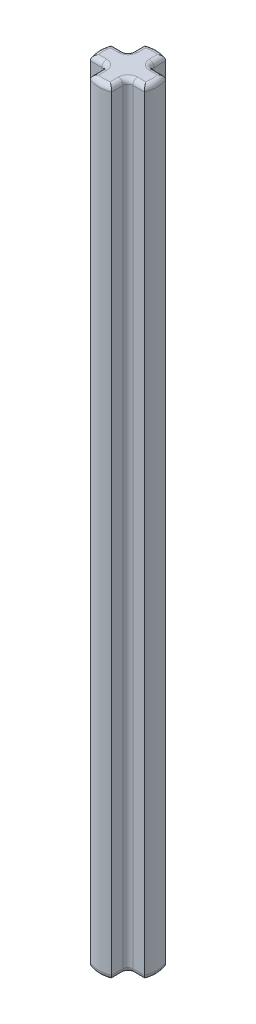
ISO-10303-21;
HEADER;
FILE_DESCRIPTION(('STEP AP214'),'2;1');
FILE_NAME('part.step','',(''),(''),'','','');
FILE_SCHEMA(('AUTOMOTIVE_DESIGN { 1 0 10303 214 1 1 1 1 }'));
ENDSEC;
DATA;
#1=APPLICATION_CONTEXT('core data for automotive mechanical design processes');
#2=APPLICATION_PROTOCOL_DEFINITION('international standard','automotive_design',2000,#1);
#3=PRODUCT_CONTEXT('',#1,'mechanical');
#4=PRODUCT('Part','Part','',(#3));
#5=PRODUCT_RELATED_PRODUCT_CATEGORY('part','',(#4));
#6=PRODUCT_DEFINITION_FORMATION('','',#4);
#7=PRODUCT_DEFINITION_CONTEXT('part definition',#1,'design');
#8=PRODUCT_DEFINITION('design','',#6,#7);
#9=PRODUCT_DEFINITION_SHAPE('','',#8);
#10=(LENGTH_UNIT() NAMED_UNIT(*) SI_UNIT(.MILLI.,.METRE.));
#11=(NAMED_UNIT(*) PLANE_ANGLE_UNIT() SI_UNIT($,.RADIAN.));
#12=(NAMED_UNIT(*) SI_UNIT($,.STERADIAN.) SOLID_ANGLE_UNIT());
#13=UNCERTAINTY_MEASURE_WITH_UNIT(LENGTH_MEASURE(1.E-05),#10,'distance_accuracy_value','');
#14=(GEOMETRIC_REPRESENTATION_CONTEXT(3) GLOBAL_UNCERTAINTY_ASSIGNED_CONTEXT((#13)) GLOBAL_UNIT_ASSIGNED_CONTEXT((#10,
#11,#12)) REPRESENTATION_CONTEXT('',''));
#15=CARTESIAN_POINT('',(0.,0.,0.));
#16=DIRECTION('',(0.,0.,1.));
#17=DIRECTION('',(1.,0.,0.));
#18=AXIS2_PLACEMENT_3D('',#15,#16,#17);
#19=CARTESIAN_POINT('',(0.,0.,0.));
#20=DIRECTION('',(0.,1.,0.));
#21=DIRECTION('',(0.,0.,1.));
#22=AXIS2_PLACEMENT_3D('',#19,#20,#21);
#23=PLANE('',#22);
#24=CARTESIAN_POINT('',(-1.28,0.,1.28));
#25=DIRECTION('',(0.,1.,0.));
#26=DIRECTION('',(0.,0.,1.));
#27=AXIS2_PLACEMENT_3D('',#24,#25,#26);
#28=CIRCLE('',#27,0.8);
#29=CARTESIAN_POINT('',(-1.28,0.,0.480000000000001));
#30=VERTEX_POINT('',#29);
#31=CARTESIAN_POINT('',(-0.48,0.,1.28));
#32=VERTEX_POINT('',#31);
#33=EDGE_CURVE('E259',#30,#32,#28,.F.);
#34=ORIENTED_EDGE('',*,*,#33,.F.);
#35=DIRECTION('',(1.,0.,0.));
#36=VECTOR('',#35,1.);
#37=CARTESIAN_POINT('',(0.,0.,0.480000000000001));
#38=LINE('',#37,#36);
#39=CARTESIAN_POINT('',(-1.94154577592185,0.,0.480000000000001));
#40=VERTEX_POINT('',#39);
#41=EDGE_CURVE('E321',#30,#40,#38,.F.);
#42=ORIENTED_EDGE('',*,*,#41,.T.);
#43=CARTESIAN_POINT('',(0.,0.,0.));
#44=DIRECTION('',(0.,1.,0.));
#45=DIRECTION('',(0.,0.,1.));
#46=AXIS2_PLACEMENT_3D('',#43,#44,#45);
#47=CIRCLE('',#46,2.);
#48=CARTESIAN_POINT('',(-1.94154577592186,0.,-0.48));
#49=VERTEX_POINT('',#48);
#50=EDGE_CURVE('E310',#40,#49,#47,.F.);
#51=ORIENTED_EDGE('',*,*,#50,.T.);
#52=DIRECTION('',(-1.,0.,0.));
#53=VECTOR('',#52,1.);
#54=CARTESIAN_POINT('',(0.,0.,-0.48));
#55=LINE('',#54,#53);
#56=CARTESIAN_POINT('',(-1.28,0.,-0.48));
#57=VERTEX_POINT('',#56);
#58=EDGE_CURVE('E298',#49,#57,#55,.F.);
#59=ORIENTED_EDGE('',*,*,#58,.T.);
#60=CARTESIAN_POINT('',(-1.28,0.,-1.28));
#61=DIRECTION('',(0.,1.,0.));
#62=DIRECTION('',(0.,0.,1.));
#63=AXIS2_PLACEMENT_3D('',#60,#61,#62);
#64=CIRCLE('',#63,0.8);
#65=CARTESIAN_POINT('',(-0.48,0.,-1.28));
#66=VERTEX_POINT('',#65);
#67=EDGE_CURVE('E295',#66,#57,#64,.F.);
#68=ORIENTED_EDGE('',*,*,#67,.F.);
#69=DIRECTION('',(0.,0.,1.));
#70=VECTOR('',#69,1.);
#71=CARTESIAN_POINT('',(-0.48,0.,0.));
#72=LINE('',#71,#70);
#73=CARTESIAN_POINT('',(-0.48,0.,-1.94154577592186));
#74=VERTEX_POINT('',#73);
#75=EDGE_CURVE('E286',#66,#74,#72,.F.);
#76=ORIENTED_EDGE('',*,*,#75,.T.);
#77=CARTESIAN_POINT('',(0.,0.,0.));
#78=DIRECTION('',(0.,1.,0.));
#79=DIRECTION('',(0.,0.,1.));
#80=AXIS2_PLACEMENT_3D('',#77,#78,#79);
#81=CIRCLE('',#80,2.);
#82=CARTESIAN_POINT('',(0.480000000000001,0.,-1.94154577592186));
#83=VERTEX_POINT('',#82);
#84=EDGE_CURVE('E291',#74,#83,#81,.F.);
#85=ORIENTED_EDGE('',*,*,#84,.T.);
#86=DIRECTION('',(0.,0.,-1.));
#87=VECTOR('',#86,1.);
#88=CARTESIAN_POINT('',(0.480000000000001,0.,0.));
#89=LINE('',#88,#87);
#90=CARTESIAN_POINT('',(0.480000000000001,0.,-1.28));
#91=VERTEX_POINT('',#90);
#92=EDGE_CURVE('E293',#83,#91,#89,.F.);
#93=ORIENTED_EDGE('',*,*,#92,.T.);
#94=CARTESIAN_POINT('',(1.28,0.,-1.28));
#95=DIRECTION('',(0.,1.,0.));
#96=DIRECTION('',(0.,0.,1.));
#97=AXIS2_PLACEMENT_3D('',#94,#95,#96);
#98=CIRCLE('',#97,0.8);
#99=CARTESIAN_POINT('',(1.28,0.,-0.48));
#100=VERTEX_POINT('',#99);
#101=EDGE_CURVE('E301',#100,#91,#98,.F.);
#102=ORIENTED_EDGE('',*,*,#101,.F.);
#103=DIRECTION('',(-1.,0.,0.));
#104=VECTOR('',#103,1.);
#105=CARTESIAN_POINT('',(0.,0.,-0.48));
#106=LINE('',#105,#104);
#107=CARTESIAN_POINT('',(1.94154577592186,0.,-0.48));
#108=VERTEX_POINT('',#107);
#109=EDGE_CURVE('E304',#100,#108,#106,.F.);
#110=ORIENTED_EDGE('',*,*,#109,.T.);
#111=CARTESIAN_POINT('',(0.,0.,0.));
#112=DIRECTION('',(0.,1.,0.));
#113=DIRECTION('',(0.,0.,1.));
#114=AXIS2_PLACEMENT_3D('',#111,#112,#113);
#115=CIRCLE('',#114,2.);
#116=CARTESIAN_POINT('',(1.94154577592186,0.,0.480000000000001));
#117=VERTEX_POINT('',#116);
#118=EDGE_CURVE('E306',#108,#117,#115,.F.);
#119=ORIENTED_EDGE('',*,*,#118,.T.);
#120=DIRECTION('',(1.,0.,0.));
#121=VECTOR('',#120,1.);
#122=CARTESIAN_POINT('',(0.,0.,0.480000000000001));
#123=LINE('',#122,#121);
#124=CARTESIAN_POINT('',(1.28,0.,0.480000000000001));
#125=VERTEX_POINT('',#124);
#126=EDGE_CURVE('E308',#117,#125,#123,.F.);
#127=ORIENTED_EDGE('',*,*,#126,.T.);
#128=CARTESIAN_POINT('',(1.28,0.,1.28));
#129=DIRECTION('',(0.,1.,0.));
#130=DIRECTION('',(0.,0.,1.));
#131=AXIS2_PLACEMENT_3D('',#128,#129,#130);
#132=CIRCLE('',#131,0.8);
#133=CARTESIAN_POINT('',(0.480000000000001,0.,1.28));
#134=VERTEX_POINT('',#133);
#135=EDGE_CURVE('E312',#134,#125,#132,.F.);
#136=ORIENTED_EDGE('',*,*,#135,.F.);
#137=DIRECTION('',(0.,0.,-1.));
#138=VECTOR('',#137,1.);
#139=CARTESIAN_POINT('',(0.480000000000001,0.,0.));
#140=LINE('',#139,#138);
#141=CARTESIAN_POINT('',(0.480000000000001,0.,1.94154577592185));
#142=VERTEX_POINT('',#141);
#143=EDGE_CURVE('E315',#134,#142,#140,.F.);
#144=ORIENTED_EDGE('',*,*,#143,.T.);
#145=CARTESIAN_POINT('',(0.,0.,0.));
#146=DIRECTION('',(0.,1.,0.));
#147=DIRECTION('',(0.,0.,1.));
#148=AXIS2_PLACEMENT_3D('',#145,#146,#147);
#149=CIRCLE('',#148,2.);
#150=CARTESIAN_POINT('',(-0.48,0.,1.94154577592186));
#151=VERTEX_POINT('',#150);
#152=EDGE_CURVE('E317',#142,#151,#149,.F.);
#153=ORIENTED_EDGE('',*,*,#152,.T.);
#154=DIRECTION('',(0.,0.,1.));
#155=VECTOR('',#154,1.);
#156=CARTESIAN_POINT('',(-0.48,0.,0.));
#157=LINE('',#156,#155);
#158=EDGE_CURVE('E319',#151,#32,#157,.F.);
#159=ORIENTED_EDGE('',*,*,#158,.T.);
#160=EDGE_LOOP('',(#34,#42,#51,#59,#68,#76,#85,#93,#102,#110,#119,#127,#136,#144,#153,#159));
#161=FACE_BOUND('',#160,.T.);
#162=ADVANCED_FACE('F33',(#161),#23,.F.);
#163=CARTESIAN_POINT('',(-0.88,64.,-2.23284571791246));
#164=DIRECTION('',(1.,0.,0.));
#165=DIRECTION('',(0.,0.,-1.));
#166=AXIS2_PLACEMENT_3D('',#163,#164,#165);
#167=PLANE('',#166);
#168=DIRECTION('',(0.,-1.,0.));
#169=VECTOR('',#168,1.);
#170=CARTESIAN_POINT('',(-0.88,64.,-2.23284571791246));
#171=LINE('',#170,#169);
#172=CARTESIAN_POINT('',(-0.88,63.6,-2.23284571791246));
#173=VERTEX_POINT('',#172);
#174=CARTESIAN_POINT('',(-0.88,0.399999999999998,-2.23284571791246));
#175=VERTEX_POINT('',#174);
#176=EDGE_CURVE('E681',#173,#175,#171,.T.);
#177=ORIENTED_EDGE('',*,*,#176,.T.);
#178=DIRECTION('',(0.,0.,1.));
#179=VECTOR('',#178,1.);
#180=CARTESIAN_POINT('',(-0.88,0.399999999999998,-2.23284571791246));
#181=LINE('',#180,#179);
#182=CARTESIAN_POINT('',(-0.88,0.399999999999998,-1.28));
#183=VERTEX_POINT('',#182);
#184=EDGE_CURVE('E381',#175,#183,#181,.T.);
#185=ORIENTED_EDGE('',*,*,#184,.T.);
#186=DIRECTION('',(0.,-1.,0.));
#187=VECTOR('',#186,1.);
#188=CARTESIAN_POINT('',(-0.88,64.,-1.28));
#189=LINE('',#188,#187);
#190=CARTESIAN_POINT('',(-0.88,63.6,-1.28));
#191=VERTEX_POINT('',#190);
#192=EDGE_CURVE('E377',#183,#191,#189,.F.);
#193=ORIENTED_EDGE('',*,*,#192,.T.);
#194=DIRECTION('',(0.,0.,1.));
#195=VECTOR('',#194,1.);
#196=CARTESIAN_POINT('',(-0.88,63.6,-2.23284571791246));
#197=LINE('',#196,#195);
#198=EDGE_CURVE('E379',#191,#173,#197,.F.);
#199=ORIENTED_EDGE('',*,*,#198,.T.);
#200=EDGE_LOOP('',(#177,#185,#193,#199));
#201=FACE_BOUND('',#200,.T.);
#202=ADVANCED_FACE('F774',(#201),#167,.F.);
#203=CARTESIAN_POINT('',(-2.23284571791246,64.,-0.88));
#204=DIRECTION('',(0.,0.,1.));
#205=DIRECTION('',(1.,0.,0.));
#206=AXIS2_PLACEMENT_3D('',#203,#204,#205);
#207=PLANE('',#206);
#208=DIRECTION('',(0.,-1.,0.));
#209=VECTOR('',#208,1.);
#210=CARTESIAN_POINT('',(-1.28,0.,-0.88));
#211=LINE('',#210,#209);
#212=CARTESIAN_POINT('',(-1.28,63.6,-0.88));
#213=VERTEX_POINT('',#212);
#214=CARTESIAN_POINT('',(-1.28,0.399999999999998,-0.88));
#215=VERTEX_POINT('',#214);
#216=EDGE_CURVE('E269',#213,#215,#211,.T.);
#217=ORIENTED_EDGE('',*,*,#216,.T.);
#218=DIRECTION('',(-1.,0.,0.));
#219=VECTOR('',#218,1.);
#220=CARTESIAN_POINT('',(-2.23284571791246,0.399999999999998,-0.88));
#221=LINE('',#220,#219);
#222=CARTESIAN_POINT('',(-2.23284571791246,0.399999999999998,-0.88));
#223=VERTEX_POINT('',#222);
#224=EDGE_CURVE('E268',#215,#223,#221,.T.);
#225=ORIENTED_EDGE('',*,*,#224,.T.);
#226=DIRECTION('',(0.,-1.,0.));
#227=VECTOR('',#226,1.);
#228=CARTESIAN_POINT('',(-2.23284571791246,64.,-0.88));
#229=LINE('',#228,#227);
#230=CARTESIAN_POINT('',(-2.23284571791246,63.6,-0.88));
#231=VERTEX_POINT('',#230);
#232=EDGE_CURVE('E251',#231,#223,#229,.T.);
#233=ORIENTED_EDGE('',*,*,#232,.F.);
#234=DIRECTION('',(-1.,0.,0.));
#235=VECTOR('',#234,1.);
#236=CARTESIAN_POINT('',(-0.88,63.6,-0.88));
#237=LINE('',#236,#235);
#238=EDGE_CURVE('E265',#231,#213,#237,.F.);
#239=ORIENTED_EDGE('',*,*,#238,.T.);
#240=EDGE_LOOP('',(#217,#225,#233,#239));
#241=FACE_BOUND('',#240,.T.);
#242=ADVANCED_FACE('F263',(#241),#207,.F.);
#243=CARTESIAN_POINT('',(0.,64.,0.));
#244=DIRECTION('',(0.,-1.,0.));
#245=DIRECTION('',(0.,0.,-1.));
#246=AXIS2_PLACEMENT_3D('',#243,#244,#245);
#247=CYLINDRICAL_SURFACE('',#246,2.4);
#248=ORIENTED_EDGE('',*,*,#232,.T.);
#249=CARTESIAN_POINT('',(0.,0.399999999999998,0.));
#250=DIRECTION('',(0.,1.,0.));
#251=DIRECTION('',(0.,0.,1.));
#252=AXIS2_PLACEMENT_3D('',#249,#250,#251);
#253=CIRCLE('',#252,2.4);
#254=CARTESIAN_POINT('',(-2.23284571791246,0.399999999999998,0.880000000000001));
#255=VERTEX_POINT('',#254);
#256=EDGE_CURVE('E258',#223,#255,#253,.T.);
#257=ORIENTED_EDGE('',*,*,#256,.T.);
#258=DIRECTION('',(0.,-1.,0.));
#259=VECTOR('',#258,1.);
#260=CARTESIAN_POINT('',(-2.23284571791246,64.,0.880000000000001));
#261=LINE('',#260,#259);
#262=CARTESIAN_POINT('',(-2.23284571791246,63.6,0.880000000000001));
#263=VERTEX_POINT('',#262);
#264=EDGE_CURVE('E253',#263,#255,#261,.T.);
#265=ORIENTED_EDGE('',*,*,#264,.F.);
#266=CARTESIAN_POINT('',(0.,63.6,0.));
#267=DIRECTION('',(0.,1.,0.));
#268=DIRECTION('',(0.,0.,1.));
#269=AXIS2_PLACEMENT_3D('',#266,#267,#268);
#270=CIRCLE('',#269,2.4);
#271=EDGE_CURVE('E248',#263,#231,#270,.F.);
#272=ORIENTED_EDGE('',*,*,#271,.T.);
#273=EDGE_LOOP('',(#248,#257,#265,#272));
#274=FACE_BOUND('',#273,.T.);
#275=ADVANCED_FACE('F250',(#274),#247,.T.);
#276=CARTESIAN_POINT('',(-0.88,64.,0.880000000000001));
#277=DIRECTION('',(0.,0.,-1.));
#278=DIRECTION('',(-1.,0.,0.));
#279=AXIS2_PLACEMENT_3D('',#276,#277,#278);
#280=PLANE('',#279);
#281=ORIENTED_EDGE('',*,*,#264,.T.);
#282=DIRECTION('',(1.,0.,0.));
#283=VECTOR('',#282,1.);
#284=CARTESIAN_POINT('',(-0.88,0.399999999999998,0.880000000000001));
#285=LINE('',#284,#283);
#286=CARTESIAN_POINT('',(-1.28,0.399999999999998,0.880000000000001));
#287=VERTEX_POINT('',#286);
#288=EDGE_CURVE('E330',#255,#287,#285,.T.);
#289=ORIENTED_EDGE('',*,*,#288,.T.);
#290=DIRECTION('',(0.,-1.,0.));
#291=VECTOR('',#290,1.);
#292=CARTESIAN_POINT('',(-1.28,64.,0.880000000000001));
#293=LINE('',#292,#291);
#294=CARTESIAN_POINT('',(-1.28,63.6,0.880000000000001));
#295=VERTEX_POINT('',#294);
#296=EDGE_CURVE('E326',#287,#295,#293,.F.);
#297=ORIENTED_EDGE('',*,*,#296,.T.);
#298=DIRECTION('',(1.,0.,0.));
#299=VECTOR('',#298,1.);
#300=CARTESIAN_POINT('',(-2.23284571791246,63.6,0.880000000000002));
#301=LINE('',#300,#299);
#302=EDGE_CURVE('E328',#295,#263,#301,.F.);
#303=ORIENTED_EDGE('',*,*,#302,.T.);
#304=EDGE_LOOP('',(#281,#289,#297,#303));
#305=FACE_BOUND('',#304,.T.);
#306=ADVANCED_FACE('F707',(#305),#280,.F.);
#307=CARTESIAN_POINT('',(-0.88,64.,0.880000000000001));
#308=DIRECTION('',(1.,0.,0.));
#309=DIRECTION('',(0.,0.,-1.));
#310=AXIS2_PLACEMENT_3D('',#307,#308,#309);
#311=PLANE('',#310);
#312=DIRECTION('',(0.,-1.,0.));
#313=VECTOR('',#312,1.);
#314=CARTESIAN_POINT('',(-0.88,0.,1.28));
#315=LINE('',#314,#313);
#316=CARTESIAN_POINT('',(-0.88,63.6,1.28));
#317=VERTEX_POINT('',#316);
#318=CARTESIAN_POINT('',(-0.88,0.399999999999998,1.28));
#319=VERTEX_POINT('',#318);
#320=EDGE_CURVE('E332',#317,#319,#315,.T.);
#321=ORIENTED_EDGE('',*,*,#320,.T.);
#322=DIRECTION('',(0.,0.,1.));
#323=VECTOR('',#322,1.);
#324=CARTESIAN_POINT('',(-0.88,0.399999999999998,0.880000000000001));
#325=LINE('',#324,#323);
#326=CARTESIAN_POINT('',(-0.88,0.399999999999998,2.23284571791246));
#327=VERTEX_POINT('',#326);
#328=EDGE_CURVE('E336',#319,#327,#325,.T.);
#329=ORIENTED_EDGE('',*,*,#328,.T.);
#330=DIRECTION('',(0.,-1.,0.));
#331=VECTOR('',#330,1.);
#332=CARTESIAN_POINT('',(-0.88,64.,2.23284571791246));
#333=LINE('',#332,#331);
#334=CARTESIAN_POINT('',(-0.88,63.6,2.23284571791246));
#335=VERTEX_POINT('',#334);
#336=EDGE_CURVE('E702',#335,#327,#333,.T.);
#337=ORIENTED_EDGE('',*,*,#336,.F.);
#338=DIRECTION('',(0.,0.,1.));
#339=VECTOR('',#338,1.);
#340=CARTESIAN_POINT('',(-0.88,63.6,0.880000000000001));
#341=LINE('',#340,#339);
#342=EDGE_CURVE('E334',#335,#317,#341,.F.);
#343=ORIENTED_EDGE('',*,*,#342,.T.);
#344=EDGE_LOOP('',(#321,#329,#337,#343));
#345=FACE_BOUND('',#344,.T.);
#346=ADVANCED_FACE('F805',(#345),#311,.F.);
#347=CARTESIAN_POINT('',(0.,64.,0.));
#348=DIRECTION('',(0.,-1.,0.));
#349=DIRECTION('',(0.,0.,-1.));
#350=AXIS2_PLACEMENT_3D('',#347,#348,#349);
#351=CYLINDRICAL_SURFACE('',#350,2.4);
#352=ORIENTED_EDGE('',*,*,#336,.T.);
#353=CARTESIAN_POINT('',(0.,0.399999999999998,0.));
#354=DIRECTION('',(0.,1.,0.));
#355=DIRECTION('',(0.,0.,1.));
#356=AXIS2_PLACEMENT_3D('',#353,#354,#355);
#357=CIRCLE('',#356,2.4);
#358=CARTESIAN_POINT('',(0.88,0.399999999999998,2.23284571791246));
#359=VERTEX_POINT('',#358);
#360=EDGE_CURVE('E341',#327,#359,#357,.T.);
#361=ORIENTED_EDGE('',*,*,#360,.T.);
#362=DIRECTION('',(0.,-1.,0.));
#363=VECTOR('',#362,1.);
#364=CARTESIAN_POINT('',(0.88,64.,2.23284571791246));
#365=LINE('',#364,#363);
#366=CARTESIAN_POINT('',(0.88,63.6,2.23284571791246));
#367=VERTEX_POINT('',#366);
#368=EDGE_CURVE('E699',#367,#359,#365,.T.);
#369=ORIENTED_EDGE('',*,*,#368,.F.);
#370=CARTESIAN_POINT('',(0.,63.6,0.));
#371=DIRECTION('',(0.,1.,0.));
#372=DIRECTION('',(0.,0.,1.));
#373=AXIS2_PLACEMENT_3D('',#370,#371,#372);
#374=CIRCLE('',#373,2.4);
#375=EDGE_CURVE('E339',#367,#335,#374,.F.);
#376=ORIENTED_EDGE('',*,*,#375,.T.);
#377=EDGE_LOOP('',(#352,#361,#369,#376));
#378=FACE_BOUND('',#377,.T.);
#379=ADVANCED_FACE('F801',(#378),#351,.T.);
#380=CARTESIAN_POINT('',(0.880000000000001,64.,2.23284571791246));
#381=DIRECTION('',(-1.,0.,0.));
#382=DIRECTION('',(0.,0.,1.));
#383=AXIS2_PLACEMENT_3D('',#380,#381,#382);
#384=PLANE('',#383);
#385=ORIENTED_EDGE('',*,*,#368,.T.);
#386=DIRECTION('',(0.,0.,-1.));
#387=VECTOR('',#386,1.);
#388=CARTESIAN_POINT('',(0.880000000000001,0.399999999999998,2.23284571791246));
#389=LINE('',#388,#387);
#390=CARTESIAN_POINT('',(0.880000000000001,0.399999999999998,1.28));
#391=VERTEX_POINT('',#390);
#392=EDGE_CURVE('E347',#359,#391,#389,.T.);
#393=ORIENTED_EDGE('',*,*,#392,.T.);
#394=DIRECTION('',(0.,-1.,0.));
#395=VECTOR('',#394,1.);
#396=CARTESIAN_POINT('',(0.880000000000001,64.,1.28));
#397=LINE('',#396,#395);
#398=CARTESIAN_POINT('',(0.880000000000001,63.6,1.28));
#399=VERTEX_POINT('',#398);
#400=EDGE_CURVE('E343',#391,#399,#397,.F.);
#401=ORIENTED_EDGE('',*,*,#400,.T.);
#402=DIRECTION('',(0.,0.,-1.));
#403=VECTOR('',#402,1.);
#404=CARTESIAN_POINT('',(0.880000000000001,63.6,2.23284571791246));
#405=LINE('',#404,#403);
#406=EDGE_CURVE('E345',#399,#367,#405,.F.);
#407=ORIENTED_EDGE('',*,*,#406,.T.);
#408=EDGE_LOOP('',(#385,#393,#401,#407));
#409=FACE_BOUND('',#408,.T.);
#410=ADVANCED_FACE('F797',(#409),#384,.F.);
#411=CARTESIAN_POINT('',(2.23284571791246,64.,0.880000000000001));
#412=DIRECTION('',(0.,0.,-1.));
#413=DIRECTION('',(-1.,0.,0.));
#414=AXIS2_PLACEMENT_3D('',#411,#412,#413);
#415=PLANE('',#414);
#416=DIRECTION('',(0.,-1.,0.));
#417=VECTOR('',#416,1.);
#418=CARTESIAN_POINT('',(1.28,0.,0.880000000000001));
#419=LINE('',#418,#417);
#420=CARTESIAN_POINT('',(1.28,63.6,0.880000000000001));
#421=VERTEX_POINT('',#420);
#422=CARTESIAN_POINT('',(1.28,0.399999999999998,0.880000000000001));
#423=VERTEX_POINT('',#422);
#424=EDGE_CURVE('E349',#421,#423,#419,.T.);
#425=ORIENTED_EDGE('',*,*,#424,.T.);
#426=DIRECTION('',(1.,0.,0.));
#427=VECTOR('',#426,1.);
#428=CARTESIAN_POINT('',(2.23284571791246,0.399999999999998,0.880000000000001));
#429=LINE('',#428,#427);
#430=CARTESIAN_POINT('',(2.23284571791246,0.399999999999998,0.880000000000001));
#431=VERTEX_POINT('',#430);
#432=EDGE_CURVE('E353',#423,#431,#429,.T.);
#433=ORIENTED_EDGE('',*,*,#432,.T.);
#434=DIRECTION('',(0.,-1.,0.));
#435=VECTOR('',#434,1.);
#436=CARTESIAN_POINT('',(2.23284571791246,64.,0.880000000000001));
#437=LINE('',#436,#435);
#438=CARTESIAN_POINT('',(2.23284571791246,63.6,0.880000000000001));
#439=VERTEX_POINT('',#438);
#440=EDGE_CURVE('E696',#439,#431,#437,.T.);
#441=ORIENTED_EDGE('',*,*,#440,.F.);
#442=DIRECTION('',(1.,0.,0.));
#443=VECTOR('',#442,1.);
#444=CARTESIAN_POINT('',(0.880000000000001,63.6,0.880000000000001));
#445=LINE('',#444,#443);
#446=EDGE_CURVE('E351',#439,#421,#445,.F.);
#447=ORIENTED_EDGE('',*,*,#446,.T.);
#448=EDGE_LOOP('',(#425,#433,#441,#447));
#449=FACE_BOUND('',#448,.T.);
#450=ADVANCED_FACE('F793',(#449),#415,.F.);
#451=CARTESIAN_POINT('',(0.,64.,0.));
#452=DIRECTION('',(0.,-1.,0.));
#453=DIRECTION('',(0.,0.,-1.));
#454=AXIS2_PLACEMENT_3D('',#451,#452,#453);
#455=CYLINDRICAL_SURFACE('',#454,2.4);
#456=ORIENTED_EDGE('',*,*,#440,.T.);
#457=CARTESIAN_POINT('',(0.,0.399999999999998,0.));
#458=DIRECTION('',(0.,1.,0.));
#459=DIRECTION('',(0.,0.,1.));
#460=AXIS2_PLACEMENT_3D('',#457,#458,#459);
#461=CIRCLE('',#460,2.4);
#462=CARTESIAN_POINT('',(2.23284571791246,0.399999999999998,-0.88));
#463=VERTEX_POINT('',#462);
#464=EDGE_CURVE('E358',#431,#463,#461,.T.);
#465=ORIENTED_EDGE('',*,*,#464,.T.);
#466=DIRECTION('',(0.,-1.,0.));
#467=VECTOR('',#466,1.);
#468=CARTESIAN_POINT('',(2.23284571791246,64.,-0.88));
#469=LINE('',#468,#467);
#470=CARTESIAN_POINT('',(2.23284571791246,63.6,-0.88));
#471=VERTEX_POINT('',#470);
#472=EDGE_CURVE('E691',#471,#463,#469,.T.);
#473=ORIENTED_EDGE('',*,*,#472,.F.);
#474=CARTESIAN_POINT('',(0.,63.6,0.));
#475=DIRECTION('',(0.,1.,0.));
#476=DIRECTION('',(0.,0.,1.));
#477=AXIS2_PLACEMENT_3D('',#474,#475,#476);
#478=CIRCLE('',#477,2.4);
#479=EDGE_CURVE('E356',#471,#439,#478,.F.);
#480=ORIENTED_EDGE('',*,*,#479,.T.);
#481=EDGE_LOOP('',(#456,#465,#473,#480));
#482=FACE_BOUND('',#481,.T.);
#483=ADVANCED_FACE('F789',(#482),#455,.T.);
#484=CARTESIAN_POINT('',(0.880000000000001,64.,-0.88));
#485=DIRECTION('',(0.,0.,1.));
#486=DIRECTION('',(1.,0.,0.));
#487=AXIS2_PLACEMENT_3D('',#484,#485,#486);
#488=PLANE('',#487);
#489=ORIENTED_EDGE('',*,*,#472,.T.);
#490=DIRECTION('',(-1.,0.,0.));
#491=VECTOR('',#490,1.);
#492=CARTESIAN_POINT('',(0.880000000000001,0.399999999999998,-0.88));
#493=LINE('',#492,#491);
#494=CARTESIAN_POINT('',(1.28,0.399999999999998,-0.88));
#495=VERTEX_POINT('',#494);
#496=EDGE_CURVE('E364',#463,#495,#493,.T.);
#497=ORIENTED_EDGE('',*,*,#496,.T.);
#498=DIRECTION('',(0.,-1.,0.));
#499=VECTOR('',#498,1.);
#500=CARTESIAN_POINT('',(1.28,64.,-0.88));
#501=LINE('',#500,#499);
#502=CARTESIAN_POINT('',(1.28,63.6,-0.88));
#503=VERTEX_POINT('',#502);
#504=EDGE_CURVE('E360',#495,#503,#501,.F.);
#505=ORIENTED_EDGE('',*,*,#504,.T.);
#506=DIRECTION('',(-1.,0.,0.));
#507=VECTOR('',#506,1.);
#508=CARTESIAN_POINT('',(2.23284571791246,63.6,-0.88));
#509=LINE('',#508,#507);
#510=EDGE_CURVE('E362',#503,#471,#509,.F.);
#511=ORIENTED_EDGE('',*,*,#510,.T.);
#512=EDGE_LOOP('',(#489,#497,#505,#511));
#513=FACE_BOUND('',#512,.T.);
#514=ADVANCED_FACE('F786',(#513),#488,.F.);
#515=CARTESIAN_POINT('',(0.880000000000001,64.,-0.88));
#516=DIRECTION('',(-1.,0.,0.));
#517=DIRECTION('',(0.,0.,1.));
#518=AXIS2_PLACEMENT_3D('',#515,#516,#517);
#519=PLANE('',#518);
#520=DIRECTION('',(0.,-1.,0.));
#521=VECTOR('',#520,1.);
#522=CARTESIAN_POINT('',(0.880000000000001,0.,-1.28));
#523=LINE('',#522,#521);
#524=CARTESIAN_POINT('',(0.880000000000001,63.6,-1.28));
#525=VERTEX_POINT('',#524);
#526=CARTESIAN_POINT('',(0.880000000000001,0.399999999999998,-1.28));
#527=VERTEX_POINT('',#526);
#528=EDGE_CURVE('E366',#525,#527,#523,.T.);
#529=ORIENTED_EDGE('',*,*,#528,.T.);
#530=DIRECTION('',(0.,0.,-1.));
#531=VECTOR('',#530,1.);
#532=CARTESIAN_POINT('',(0.880000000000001,0.399999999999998,-0.88));
#533=LINE('',#532,#531);
#534=CARTESIAN_POINT('',(0.880000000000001,0.399999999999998,-2.23284571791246));
#535=VERTEX_POINT('',#534);
#536=EDGE_CURVE('E370',#527,#535,#533,.T.);
#537=ORIENTED_EDGE('',*,*,#536,.T.);
#538=DIRECTION('',(0.,-1.,0.));
#539=VECTOR('',#538,1.);
#540=CARTESIAN_POINT('',(0.880000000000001,64.,-2.23284571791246));
#541=LINE('',#540,#539);
#542=CARTESIAN_POINT('',(0.880000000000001,63.6,-2.23284571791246));
#543=VERTEX_POINT('',#542);
#544=EDGE_CURVE('E685',#543,#535,#541,.T.);
#545=ORIENTED_EDGE('',*,*,#544,.F.);
#546=DIRECTION('',(0.,0.,-1.));
#547=VECTOR('',#546,1.);
#548=CARTESIAN_POINT('',(0.880000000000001,63.6,-0.88));
#549=LINE('',#548,#547);
#550=EDGE_CURVE('E368',#543,#525,#549,.F.);
#551=ORIENTED_EDGE('',*,*,#550,.T.);
#552=EDGE_LOOP('',(#529,#537,#545,#551));
#553=FACE_BOUND('',#552,.T.);
#554=ADVANCED_FACE('F727',(#553),#519,.F.);
#555=CARTESIAN_POINT('',(0.,64.,0.));
#556=DIRECTION('',(0.,-1.,0.));
#557=DIRECTION('',(0.,0.,-1.));
#558=AXIS2_PLACEMENT_3D('',#555,#556,#557);
#559=CYLINDRICAL_SURFACE('',#558,2.4);
#560=ORIENTED_EDGE('',*,*,#544,.T.);
#561=CARTESIAN_POINT('',(0.,0.399999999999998,0.));
#562=DIRECTION('',(0.,1.,0.));
#563=DIRECTION('',(0.,0.,1.));
#564=AXIS2_PLACEMENT_3D('',#561,#562,#563);
#565=CIRCLE('',#564,2.4);
#566=EDGE_CURVE('E375',#535,#175,#565,.T.);
#567=ORIENTED_EDGE('',*,*,#566,.T.);
#568=ORIENTED_EDGE('',*,*,#176,.F.);
#569=CARTESIAN_POINT('',(0.,63.6,0.));
#570=DIRECTION('',(0.,1.,0.));
#571=DIRECTION('',(0.,0.,1.));
#572=AXIS2_PLACEMENT_3D('',#569,#570,#571);
#573=CIRCLE('',#572,2.4);
#574=EDGE_CURVE('E373',#173,#543,#573,.F.);
#575=ORIENTED_EDGE('',*,*,#574,.T.);
#576=EDGE_LOOP('',(#560,#567,#568,#575));
#577=FACE_BOUND('',#576,.T.);
#578=ADVANCED_FACE('F731',(#577),#559,.T.);
#579=CARTESIAN_POINT('',(0.,64.,0.));
#580=DIRECTION('',(0.,1.,0.));
#581=DIRECTION('',(0.,0.,1.));
#582=AXIS2_PLACEMENT_3D('',#579,#580,#581);
#583=PLANE('',#582);
#584=CARTESIAN_POINT('',(0.,64.,0.));
#585=DIRECTION('',(0.,1.,0.));
#586=DIRECTION('',(0.,0.,1.));
#587=AXIS2_PLACEMENT_3D('',#584,#585,#586);
#588=CIRCLE('',#587,2.);
#589=CARTESIAN_POINT('',(1.94154577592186,64.,0.480000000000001));
#590=VERTEX_POINT('',#589);
#591=CARTESIAN_POINT('',(1.94154577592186,64.,-0.48));
#592=VERTEX_POINT('',#591);
#593=EDGE_CURVE('E59',#590,#592,#588,.T.);
#594=ORIENTED_EDGE('',*,*,#593,.T.);
#595=DIRECTION('',(-1.,0.,0.));
#596=VECTOR('',#595,1.);
#597=CARTESIAN_POINT('',(0.880000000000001,64.,-0.48));
#598=LINE('',#597,#596);
#599=CARTESIAN_POINT('',(1.28,64.,-0.48));
#600=VERTEX_POINT('',#599);
#601=EDGE_CURVE('E11',#592,#600,#598,.T.);
#602=ORIENTED_EDGE('',*,*,#601,.T.);
#603=CARTESIAN_POINT('',(1.28,64.,-1.28));
#604=DIRECTION('',(0.,1.,0.));
#605=DIRECTION('',(0.,0.,1.));
#606=AXIS2_PLACEMENT_3D('',#603,#604,#605);
#607=CIRCLE('',#606,0.8);
#608=CARTESIAN_POINT('',(0.480000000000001,64.,-1.28));
#609=VERTEX_POINT('',#608);
#610=EDGE_CURVE('E48',#609,#600,#607,.T.);
#611=ORIENTED_EDGE('',*,*,#610,.F.);
#612=DIRECTION('',(0.,0.,-1.));
#613=VECTOR('',#612,1.);
#614=CARTESIAN_POINT('',(0.480000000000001,64.,-2.23284571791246));
#615=LINE('',#614,#613);
#616=CARTESIAN_POINT('',(0.480000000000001,64.,-1.94154577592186));
#617=VERTEX_POINT('',#616);
#618=EDGE_CURVE('E405',#609,#617,#615,.T.);
#619=ORIENTED_EDGE('',*,*,#618,.T.);
#620=CARTESIAN_POINT('',(0.,64.,0.));
#621=DIRECTION('',(0.,1.,0.));
#622=DIRECTION('',(0.,0.,1.));
#623=AXIS2_PLACEMENT_3D('',#620,#621,#622);
#624=CIRCLE('',#623,2.);
#625=CARTESIAN_POINT('',(-0.48,64.,-1.94154577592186));
#626=VERTEX_POINT('',#625);
#627=EDGE_CURVE('E393',#617,#626,#624,.T.);
#628=ORIENTED_EDGE('',*,*,#627,.T.);
#629=DIRECTION('',(0.,0.,1.));
#630=VECTOR('',#629,1.);
#631=CARTESIAN_POINT('',(-0.48,64.,-0.88));
#632=LINE('',#631,#630);
#633=CARTESIAN_POINT('',(-0.48,64.,-1.28));
#634=VERTEX_POINT('',#633);
#635=EDGE_CURVE('E386',#626,#634,#632,.T.);
#636=ORIENTED_EDGE('',*,*,#635,.T.);
#637=CARTESIAN_POINT('',(-1.28,64.,-1.28));
#638=DIRECTION('',(0.,1.,0.));
#639=DIRECTION('',(0.,0.,1.));
#640=AXIS2_PLACEMENT_3D('',#637,#638,#639);
#641=CIRCLE('',#640,0.8);
#642=CARTESIAN_POINT('',(-1.28,64.,-0.48));
#643=VERTEX_POINT('',#642);
#644=EDGE_CURVE('E383',#643,#634,#641,.T.);
#645=ORIENTED_EDGE('',*,*,#644,.F.);
#646=DIRECTION('',(-1.,0.,0.));
#647=VECTOR('',#646,1.);
#648=CARTESIAN_POINT('',(-2.23284571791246,64.,-0.48));
#649=LINE('',#648,#647);
#650=CARTESIAN_POINT('',(-1.94154577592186,64.,-0.48));
#651=VERTEX_POINT('',#650);
#652=EDGE_CURVE('E388',#643,#651,#649,.T.);
#653=ORIENTED_EDGE('',*,*,#652,.T.);
#654=CARTESIAN_POINT('',(0.,64.,0.));
#655=DIRECTION('',(0.,1.,0.));
#656=DIRECTION('',(0.,0.,1.));
#657=AXIS2_PLACEMENT_3D('',#654,#655,#656);
#658=CIRCLE('',#657,2.);
#659=CARTESIAN_POINT('',(-1.94154577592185,64.,0.480000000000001));
#660=VERTEX_POINT('',#659);
#661=EDGE_CURVE('E275',#651,#660,#658,.T.);
#662=ORIENTED_EDGE('',*,*,#661,.T.);
#663=DIRECTION('',(1.,0.,0.));
#664=VECTOR('',#663,1.);
#665=CARTESIAN_POINT('',(-0.88,64.,0.480000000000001));
#666=LINE('',#665,#664);
#667=CARTESIAN_POINT('',(-1.28,64.,0.480000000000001));
#668=VERTEX_POINT('',#667);
#669=EDGE_CURVE('E391',#660,#668,#666,.T.);
#670=ORIENTED_EDGE('',*,*,#669,.T.);
#671=CARTESIAN_POINT('',(-1.28,64.,1.28));
#672=DIRECTION('',(0.,1.,0.));
#673=DIRECTION('',(0.,0.,1.));
#674=AXIS2_PLACEMENT_3D('',#671,#672,#673);
#675=CIRCLE('',#674,0.8);
#676=CARTESIAN_POINT('',(-0.48,64.,1.28));
#677=VERTEX_POINT('',#676);
#678=EDGE_CURVE('E396',#677,#668,#675,.T.);
#679=ORIENTED_EDGE('',*,*,#678,.F.);
#680=DIRECTION('',(0.,0.,1.));
#681=VECTOR('',#680,1.);
#682=CARTESIAN_POINT('',(-0.48,64.,2.23284571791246));
#683=LINE('',#682,#681);
#684=CARTESIAN_POINT('',(-0.48,64.,1.94154577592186));
#685=VERTEX_POINT('',#684);
#686=EDGE_CURVE('E399',#677,#685,#683,.T.);
#687=ORIENTED_EDGE('',*,*,#686,.T.);
#688=CARTESIAN_POINT('',(0.,64.,0.));
#689=DIRECTION('',(0.,1.,0.));
#690=DIRECTION('',(0.,0.,1.));
#691=AXIS2_PLACEMENT_3D('',#688,#689,#690);
#692=CIRCLE('',#691,2.);
#693=CARTESIAN_POINT('',(0.48,64.,1.94154577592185));
#694=VERTEX_POINT('',#693);
#695=EDGE_CURVE('E401',#685,#694,#692,.T.);
#696=ORIENTED_EDGE('',*,*,#695,.T.);
#697=DIRECTION('',(0.,0.,-1.));
#698=VECTOR('',#697,1.);
#699=CARTESIAN_POINT('',(0.480000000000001,64.,0.880000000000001));
#700=LINE('',#699,#698);
#701=CARTESIAN_POINT('',(0.480000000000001,64.,1.28));
#702=VERTEX_POINT('',#701);
#703=EDGE_CURVE('E403',#694,#702,#700,.T.);
#704=ORIENTED_EDGE('',*,*,#703,.T.);
#705=CARTESIAN_POINT('',(1.28,64.,1.28));
#706=DIRECTION('',(0.,1.,0.));
#707=DIRECTION('',(0.,0.,1.));
#708=AXIS2_PLACEMENT_3D('',#705,#706,#707);
#709=CIRCLE('',#708,0.8);
#710=CARTESIAN_POINT('',(1.28,64.,0.480000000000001));
#711=VERTEX_POINT('',#710);
#712=EDGE_CURVE('E407',#711,#702,#709,.T.);
#713=ORIENTED_EDGE('',*,*,#712,.F.);
#714=DIRECTION('',(1.,0.,0.));
#715=VECTOR('',#714,1.);
#716=CARTESIAN_POINT('',(2.23284571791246,64.,0.480000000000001));
#717=LINE('',#716,#715);
#718=EDGE_CURVE('E410',#711,#590,#717,.T.);
#719=ORIENTED_EDGE('',*,*,#718,.T.);
#720=EDGE_LOOP('',(#594,#602,#611,#619,#628,#636,#645,#653,#662,#670,#679,#687,#696,#704,#713,#719));
#721=FACE_BOUND('',#720,.T.);
#722=ADVANCED_FACE('F781',(#721),#583,.T.);
#723=CARTESIAN_POINT('',(0.,63.6,0.480000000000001));
#724=DIRECTION('',(-1.,0.,0.));
#725=DIRECTION('',(0.,0.,1.));
#726=AXIS2_PLACEMENT_3D('',#723,#724,#725);
#727=CYLINDRICAL_SURFACE('',#726,0.4);
#728=CARTESIAN_POINT('',(1.28,63.6,0.480000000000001));
#729=DIRECTION('',(-1.,0.,0.));
#730=DIRECTION('',(0.,0.,1.));
#731=AXIS2_PLACEMENT_3D('',#728,#729,#730);
#732=CIRCLE('',#731,0.4);
#733=EDGE_CURVE('E674',#421,#711,#732,.T.);
#734=ORIENTED_EDGE('',*,*,#733,.F.);
#735=ORIENTED_EDGE('',*,*,#446,.F.);
#736=CARTESIAN_POINT('',(2.23284571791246,63.6,0.880000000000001));
#737=CARTESIAN_POINT('',(2.23286229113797,63.6196677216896,0.880027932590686));
#738=CARTESIAN_POINT('',(2.23185960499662,63.6393093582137,0.878551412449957));
#739=CARTESIAN_POINT('',(2.22795221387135,63.6778900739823,0.872817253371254));
#740=CARTESIAN_POINT('',(2.22505712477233,63.6968321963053,0.868573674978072));
#741=CARTESIAN_POINT('',(2.21750324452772,63.7335523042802,0.857535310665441));
#742=CARTESIAN_POINT('',(2.21284643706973,63.7513315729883,0.850743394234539));
#743=CARTESIAN_POINT('',(2.20197052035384,63.7853742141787,0.834948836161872));
#744=CARTESIAN_POINT('',(2.19574983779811,63.8016360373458,0.825943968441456));
#745=CARTESIAN_POINT('',(2.18156387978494,63.8332696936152,0.805515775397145));
#746=CARTESIAN_POINT('',(2.1735174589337,63.8485327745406,0.793981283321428));
#747=CARTESIAN_POINT('',(2.15618491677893,63.8768786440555,0.769295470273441));
#748=CARTESIAN_POINT('',(2.14689846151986,63.8899608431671,0.756143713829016));
#749=CARTESIAN_POINT('',(2.12572929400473,63.9158258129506,0.726380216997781));
#750=CARTESIAN_POINT('',(2.11366981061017,63.9282155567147,0.709553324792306));
#751=CARTESIAN_POINT('',(2.08850314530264,63.9499832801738,0.674765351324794));
#752=CARTESIAN_POINT('',(2.07539489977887,63.9593581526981,0.656803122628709));
#753=CARTESIAN_POINT('',(2.04585046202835,63.9766538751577,0.616725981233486));
#754=CARTESIAN_POINT('',(2.02925334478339,63.9839655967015,0.594467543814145));
#755=CARTESIAN_POINT('',(1.99535297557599,63.9945738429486,0.549587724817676));
#756=CARTESIAN_POINT('',(1.97805064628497,63.9978754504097,0.526966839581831));
#757=CARTESIAN_POINT('',(1.95507409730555,63.9996873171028,0.497330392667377));
#758=CARTESIAN_POINT('',(1.94956846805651,63.9999307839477,0.490258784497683));
#759=CARTESIAN_POINT('',(1.94321386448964,63.9999957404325,0.482131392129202));
#760=CARTESIAN_POINT('',(1.94237999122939,63.9999999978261,0.481065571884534));
#761=CARTESIAN_POINT('',(1.94154577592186,64.,0.480000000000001));
#762=B_SPLINE_CURVE_WITH_KNOTS('',3,(#736,#737,#738,#739,#740,#741,#742,#743,#744,#745,#746,
#747,#748,#749,#750,#751,#752,#753,#754,#755,#756,#757,#758,#759,#760,#761),.UNSPECIFIED.,.F.,
.F.,(4,2,2,2,2,2,2,2,2,2,2,2,4),(0.,0.058881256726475,0.117465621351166,0.175984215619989,
0.234561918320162,0.296588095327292,0.358631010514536,0.430741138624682,0.502925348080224,
0.588744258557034,0.674454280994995,0.701345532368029,0.705405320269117),.UNSPECIFIED.);
#763=EDGE_CURVE('E38',#590,#439,#762,.F.);
#764=ORIENTED_EDGE('',*,*,#763,.F.);
#765=ORIENTED_EDGE('',*,*,#718,.F.);
#766=EDGE_LOOP('',(#734,#735,#764,#765));
#767=FACE_BOUND('',#766,.T.);
#768=ADVANCED_FACE('F35',(#767),#727,.T.);
#769=CARTESIAN_POINT('',(0.,63.6,0.));
#770=DIRECTION('',(0.,1.,0.));
#771=DIRECTION('',(0.,0.,1.));
#772=AXIS2_PLACEMENT_3D('',#769,#770,#771);
#773=TOROIDAL_SURFACE('',#772,2.,0.4);
#774=ORIENTED_EDGE('',*,*,#763,.T.);
#775=ORIENTED_EDGE('',*,*,#479,.F.);
#776=CARTESIAN_POINT('',(2.23284571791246,63.6,-0.88));
#777=CARTESIAN_POINT('',(2.23286229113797,63.6196677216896,-0.880027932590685));
#778=CARTESIAN_POINT('',(2.23185960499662,63.6393093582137,-0.878551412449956));
#779=CARTESIAN_POINT('',(2.22795221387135,63.6778900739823,-0.872817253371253));
#780=CARTESIAN_POINT('',(2.22505712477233,63.6968321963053,-0.868573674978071));
#781=CARTESIAN_POINT('',(2.21750324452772,63.7335523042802,-0.85753531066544));
#782=CARTESIAN_POINT('',(2.21284643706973,63.7513315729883,-0.850743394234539));
#783=CARTESIAN_POINT('',(2.20197052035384,63.7853742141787,-0.834948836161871));
#784=CARTESIAN_POINT('',(2.19574983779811,63.8016360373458,-0.825943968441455));
#785=CARTESIAN_POINT('',(2.18156387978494,63.8332696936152,-0.805515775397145));
#786=CARTESIAN_POINT('',(2.17351745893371,63.8485327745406,-0.793981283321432));
#787=CARTESIAN_POINT('',(2.15618491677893,63.8768786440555,-0.769295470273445));
#788=CARTESIAN_POINT('',(2.14689846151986,63.8899608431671,-0.756143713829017));
#789=CARTESIAN_POINT('',(2.12572929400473,63.9158258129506,-0.726380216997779));
#790=CARTESIAN_POINT('',(2.11366981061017,63.9282155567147,-0.709553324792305));
#791=CARTESIAN_POINT('',(2.08850314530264,63.9499832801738,-0.674765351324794));
#792=CARTESIAN_POINT('',(2.07539489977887,63.9593581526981,-0.656803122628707));
#793=CARTESIAN_POINT('',(2.04585046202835,63.9766538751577,-0.616725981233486));
#794=CARTESIAN_POINT('',(2.02925334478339,63.9839655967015,-0.594467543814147));
#795=CARTESIAN_POINT('',(1.99535297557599,63.9945738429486,-0.549587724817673));
#796=CARTESIAN_POINT('',(1.97805064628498,63.9978754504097,-0.52696683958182));
#797=CARTESIAN_POINT('',(1.95507409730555,63.9996873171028,-0.497330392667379));
#798=CARTESIAN_POINT('',(1.9495684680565,63.9999307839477,-0.49025878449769));
#799=CARTESIAN_POINT('',(1.94321386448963,63.9999957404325,-0.482131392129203));
#800=CARTESIAN_POINT('',(1.94237999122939,63.9999999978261,-0.481065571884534));
#801=CARTESIAN_POINT('',(1.94154577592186,64.,-0.48));
#802=B_SPLINE_CURVE_WITH_KNOTS('',3,(#776,#777,#778,#779,#780,#781,#782,#783,#784,#785,#786,
#787,#788,#789,#790,#791,#792,#793,#794,#795,#796,#797,#798,#799,#800,#801),.UNSPECIFIED.,.F.,
.F.,(4,2,2,2,2,2,2,2,2,2,2,2,4),(0.,0.058881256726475,0.117465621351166,0.175984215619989,
0.234561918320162,0.296588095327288,0.358631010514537,0.430741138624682,0.502925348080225,
0.588744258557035,0.674454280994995,0.70134553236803,0.705405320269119),.UNSPECIFIED.);
#803=EDGE_CURVE('E668',#592,#471,#802,.F.);
#804=ORIENTED_EDGE('',*,*,#803,.F.);
#805=ORIENTED_EDGE('',*,*,#593,.F.);
#806=EDGE_LOOP('',(#774,#775,#804,#805));
#807=FACE_BOUND('',#806,.T.);
#808=ADVANCED_FACE('F658',(#807),#773,.T.);
#809=CARTESIAN_POINT('',(1.28,63.6,1.28));
#810=DIRECTION('',(0.,1.,0.));
#811=DIRECTION('',(0.,0.,1.));
#812=AXIS2_PLACEMENT_3D('',#809,#810,#811);
#813=TOROIDAL_SURFACE('',#812,0.8,0.4);
#814=ORIENTED_EDGE('',*,*,#733,.T.);
#815=ORIENTED_EDGE('',*,*,#712,.T.);
#816=CARTESIAN_POINT('',(0.480000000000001,63.6,1.28));
#817=DIRECTION('',(0.,0.,-1.));
#818=DIRECTION('',(-1.,0.,0.));
#819=AXIS2_PLACEMENT_3D('',#816,#817,#818);
#820=CIRCLE('',#819,0.4);
#821=EDGE_CURVE('E675',#399,#702,#820,.F.);
#822=ORIENTED_EDGE('',*,*,#821,.F.);
#823=CARTESIAN_POINT('',(1.28,63.6,1.28));
#824=DIRECTION('',(0.,1.,0.));
#825=DIRECTION('',(0.,0.,1.));
#826=AXIS2_PLACEMENT_3D('',#823,#824,#825);
#827=CIRCLE('',#826,0.4);
#828=EDGE_CURVE('E645',#421,#399,#827,.T.);
#829=ORIENTED_EDGE('',*,*,#828,.F.);
#830=EDGE_LOOP('',(#814,#815,#822,#829));
#831=FACE_BOUND('',#830,.T.);
#832=ADVANCED_FACE('F662',(#831),#813,.T.);
#833=CARTESIAN_POINT('',(0.,63.6,-0.48));
#834=DIRECTION('',(1.,0.,0.));
#835=DIRECTION('',(0.,0.,-1.));
#836=AXIS2_PLACEMENT_3D('',#833,#834,#835);
#837=CYLINDRICAL_SURFACE('',#836,0.4);
#838=ORIENTED_EDGE('',*,*,#803,.T.);
#839=ORIENTED_EDGE('',*,*,#510,.F.);
#840=CARTESIAN_POINT('',(1.28,63.6,-0.48));
#841=DIRECTION('',(-1.,0.,0.));
#842=DIRECTION('',(0.,0.,1.));
#843=AXIS2_PLACEMENT_3D('',#840,#841,#842);
#844=CIRCLE('',#843,0.4);
#845=EDGE_CURVE('E646',#600,#503,#844,.T.);
#846=ORIENTED_EDGE('',*,*,#845,.F.);
#847=ORIENTED_EDGE('',*,*,#601,.F.);
#848=EDGE_LOOP('',(#838,#839,#846,#847));
#849=FACE_BOUND('',#848,.T.);
#850=ADVANCED_FACE('F664',(#849),#837,.T.);
#851=CARTESIAN_POINT('',(0.480000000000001,63.6,0.));
#852=DIRECTION('',(0.,0.,1.));
#853=DIRECTION('',(1.,0.,0.));
#854=AXIS2_PLACEMENT_3D('',#851,#852,#853);
#855=CYLINDRICAL_SURFACE('',#854,0.4);
#856=ORIENTED_EDGE('',*,*,#821,.T.);
#857=ORIENTED_EDGE('',*,*,#703,.F.);
#858=CARTESIAN_POINT('',(0.88,63.6,2.23284571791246));
#859=CARTESIAN_POINT('',(0.880027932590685,63.6196677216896,2.23286229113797));
#860=CARTESIAN_POINT('',(0.878551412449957,63.6393093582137,2.23185960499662));
#861=CARTESIAN_POINT('',(0.872817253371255,63.6778900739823,2.22795221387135));
#862=CARTESIAN_POINT('',(0.868573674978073,63.6968321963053,2.22505712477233));
#863=CARTESIAN_POINT('',(0.857535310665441,63.7335523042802,2.21750324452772));
#864=CARTESIAN_POINT('',(0.850743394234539,63.7513315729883,2.21284643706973));
#865=CARTESIAN_POINT('',(0.834948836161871,63.7853742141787,2.20197052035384));
#866=CARTESIAN_POINT('',(0.825943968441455,63.8016360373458,2.19574983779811));
#867=CARTESIAN_POINT('',(0.805515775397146,63.8332696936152,2.18156387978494));
#868=CARTESIAN_POINT('',(0.793981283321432,63.8485327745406,2.17351745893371));
#869=CARTESIAN_POINT('',(0.769295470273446,63.8768786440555,2.15618491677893));
#870=CARTESIAN_POINT('',(0.756143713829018,63.8899608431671,2.14689846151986));
#871=CARTESIAN_POINT('',(0.72638021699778,63.9158258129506,2.12572929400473));
#872=CARTESIAN_POINT('',(0.709553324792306,63.9282155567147,2.11366981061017));
#873=CARTESIAN_POINT('',(0.674765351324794,63.9499832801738,2.08850314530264));
#874=CARTESIAN_POINT('',(0.656803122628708,63.9593581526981,2.07539489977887));
#875=CARTESIAN_POINT('',(0.616725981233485,63.9766538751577,2.04585046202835));
#876=CARTESIAN_POINT('',(0.594467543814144,63.9839655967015,2.02925334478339));
#877=CARTESIAN_POINT('',(0.549587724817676,63.9945738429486,1.99535297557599));
#878=CARTESIAN_POINT('',(0.52696683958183,63.9978754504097,1.97805064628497));
#879=CARTESIAN_POINT('',(0.497330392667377,63.9996873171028,1.95507409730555));
#880=CARTESIAN_POINT('',(0.490258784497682,63.9999307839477,1.94956846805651));
#881=CARTESIAN_POINT('',(0.482131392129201,63.9999957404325,1.94321386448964));
#882=CARTESIAN_POINT('',(0.481065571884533,63.9999999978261,1.94237999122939));
#883=CARTESIAN_POINT('',(0.480000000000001,64.,1.94154577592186));
#884=B_SPLINE_CURVE_WITH_KNOTS('',3,(#858,#859,#860,#861,#862,#863,#864,#865,#866,#867,#868,
#869,#870,#871,#872,#873,#874,#875,#876,#877,#878,#879,#880,#881,#882,#883),.UNSPECIFIED.,.F.,
.F.,(4,2,2,2,2,2,2,2,2,2,2,2,4),(0.,0.058881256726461,0.117465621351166,0.175984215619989,
0.234561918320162,0.296588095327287,0.358631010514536,0.430741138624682,0.502925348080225,
0.588744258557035,0.674454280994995,0.70134553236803,0.705405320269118),.UNSPECIFIED.);
#885=EDGE_CURVE('E759',#367,#694,#884,.T.);
#886=ORIENTED_EDGE('',*,*,#885,.F.);
#887=ORIENTED_EDGE('',*,*,#406,.F.);
#888=EDGE_LOOP('',(#856,#857,#886,#887));
#889=FACE_BOUND('',#888,.T.);
#890=ADVANCED_FACE('F656',(#889),#855,.T.);
#891=CARTESIAN_POINT('',(1.28,64.,1.28));
#892=DIRECTION('',(0.,1.,0.));
#893=DIRECTION('',(0.,0.,1.));
#894=AXIS2_PLACEMENT_3D('',#891,#892,#893);
#895=CYLINDRICAL_SURFACE('',#894,0.4);
#896=ORIENTED_EDGE('',*,*,#828,.T.);
#897=ORIENTED_EDGE('',*,*,#400,.F.);
#898=CARTESIAN_POINT('',(1.28,0.399999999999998,1.28));
#899=DIRECTION('',(0.,1.,0.));
#900=DIRECTION('',(0.,0.,1.));
#901=AXIS2_PLACEMENT_3D('',#898,#899,#900);
#902=CIRCLE('',#901,0.4);
#903=EDGE_CURVE('E611',#423,#391,#902,.T.);
#904=ORIENTED_EDGE('',*,*,#903,.F.);
#905=ORIENTED_EDGE('',*,*,#424,.F.);
#906=EDGE_LOOP('',(#896,#897,#904,#905));
#907=FACE_BOUND('',#906,.T.);
#908=ADVANCED_FACE('F653',(#907),#895,.F.);
#909=CARTESIAN_POINT('',(2.23284571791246,0.399999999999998,0.480000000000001));
#910=DIRECTION('',(1.,0.,0.));
#911=DIRECTION('',(0.,0.,-1.));
#912=AXIS2_PLACEMENT_3D('',#909,#910,#911);
#913=CYLINDRICAL_SURFACE('',#912,0.4);
#914=CARTESIAN_POINT('',(1.28,0.4,0.480000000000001));
#915=DIRECTION('',(-1.,0.,0.));
#916=DIRECTION('',(0.,0.,1.));
#917=AXIS2_PLACEMENT_3D('',#914,#915,#916);
#918=CIRCLE('',#917,0.4);
#919=EDGE_CURVE('E607',#125,#423,#918,.T.);
#920=ORIENTED_EDGE('',*,*,#919,.F.);
#921=ORIENTED_EDGE('',*,*,#126,.F.);
#922=CARTESIAN_POINT('',(2.23284571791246,0.399999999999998,0.880000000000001));
#923=CARTESIAN_POINT('',(2.23286229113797,0.380332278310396,0.880027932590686));
#924=CARTESIAN_POINT('',(2.23185960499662,0.360690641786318,0.878551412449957));
#925=CARTESIAN_POINT('',(2.22795221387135,0.322109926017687,0.872817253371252));
#926=CARTESIAN_POINT('',(2.22505712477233,0.303167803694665,0.86857367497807));
#927=CARTESIAN_POINT('',(2.21750324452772,0.266447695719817,0.85753531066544));
#928=CARTESIAN_POINT('',(2.21284643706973,0.248668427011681,0.850743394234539));
#929=CARTESIAN_POINT('',(2.20197052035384,0.214625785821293,0.834948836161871));
#930=CARTESIAN_POINT('',(2.19574983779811,0.198363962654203,0.825943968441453));
#931=CARTESIAN_POINT('',(2.18156387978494,0.166730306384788,0.805515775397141));
#932=CARTESIAN_POINT('',(2.1735174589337,0.151467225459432,0.793981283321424));
#933=CARTESIAN_POINT('',(2.15618491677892,0.12312135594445,0.769295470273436));
#934=CARTESIAN_POINT('',(2.14689846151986,0.110039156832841,0.756143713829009));
#935=CARTESIAN_POINT('',(2.12572929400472,0.0841741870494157,0.726380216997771));
#936=CARTESIAN_POINT('',(2.11366981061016,0.0717844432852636,0.709553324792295));
#937=CARTESIAN_POINT('',(2.08850314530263,0.0500167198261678,0.674765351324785));
#938=CARTESIAN_POINT('',(2.07539489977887,0.0406418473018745,0.656803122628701));
#939=CARTESIAN_POINT('',(2.04585046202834,0.0233461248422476,0.616725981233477));
#940=CARTESIAN_POINT('',(2.02925334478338,0.0160344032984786,0.594467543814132));
#941=CARTESIAN_POINT('',(1.99535297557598,0.00542615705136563,0.549587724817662));
#942=CARTESIAN_POINT('',(1.97805064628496,0.00212454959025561,0.526966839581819));
#943=CARTESIAN_POINT('',(1.95507409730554,0.000312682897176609,0.497330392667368));
#944=CARTESIAN_POINT('',(1.94956846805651,6.92160523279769E-05,0.490258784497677));
#945=CARTESIAN_POINT('',(1.94321386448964,4.25956751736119E-06,0.482131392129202));
#946=CARTESIAN_POINT('',(1.94237999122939,2.17393375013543E-09,0.481065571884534));
#947=CARTESIAN_POINT('',(1.94154577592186,0.,0.480000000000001));
#948=B_SPLINE_CURVE_WITH_KNOTS('',3,(#922,#923,#924,#925,#926,#927,#928,#929,#930,#931,#932,
#933,#934,#935,#936,#937,#938,#939,#940,#941,#942,#943,#944,#945,#946,#947),.UNSPECIFIED.,.F.,
.F.,(4,2,2,2,2,2,2,2,2,2,2,2,4),(0.,0.0588812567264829,0.117465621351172,0.175984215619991,
0.234561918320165,0.296588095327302,0.358631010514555,0.430741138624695,0.502925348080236,
0.588744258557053,0.674454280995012,0.701345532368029,0.705405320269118),.UNSPECIFIED.);
#949=EDGE_CURVE('E636',#431,#117,#948,.T.);
#950=ORIENTED_EDGE('',*,*,#949,.F.);
#951=ORIENTED_EDGE('',*,*,#432,.F.);
#952=EDGE_LOOP('',(#920,#921,#950,#951));
#953=FACE_BOUND('',#952,.T.);
#954=ADVANCED_FACE('F631',(#953),#913,.T.);
#955=CARTESIAN_POINT('',(0.,0.399999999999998,0.));
#956=DIRECTION('',(0.,1.,0.));
#957=DIRECTION('',(0.,0.,1.));
#958=AXIS2_PLACEMENT_3D('',#955,#956,#957);
#959=TOROIDAL_SURFACE('',#958,2.,0.4);
#960=ORIENTED_EDGE('',*,*,#949,.T.);
#961=ORIENTED_EDGE('',*,*,#118,.F.);
#962=CARTESIAN_POINT('',(2.23284571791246,0.399999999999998,-0.88));
#963=CARTESIAN_POINT('',(2.23286229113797,0.380332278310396,-0.880027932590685));
#964=CARTESIAN_POINT('',(2.23185960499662,0.360690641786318,-0.878551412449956));
#965=CARTESIAN_POINT('',(2.22795221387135,0.322109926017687,-0.872817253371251));
#966=CARTESIAN_POINT('',(2.22505712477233,0.303167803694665,-0.868573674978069));
#967=CARTESIAN_POINT('',(2.21750324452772,0.266447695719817,-0.857535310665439));
#968=CARTESIAN_POINT('',(2.21284643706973,0.248668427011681,-0.850743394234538));
#969=CARTESIAN_POINT('',(2.20197052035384,0.214625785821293,-0.83494883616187));
#970=CARTESIAN_POINT('',(2.19574983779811,0.198363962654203,-0.825943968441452));
#971=CARTESIAN_POINT('',(2.18156387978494,0.166730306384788,-0.80551577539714));
#972=CARTESIAN_POINT('',(2.1735174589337,0.151467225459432,-0.793981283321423));
#973=CARTESIAN_POINT('',(2.15618491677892,0.123121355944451,-0.769295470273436));
#974=CARTESIAN_POINT('',(2.14689846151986,0.110039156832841,-0.756143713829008));
#975=CARTESIAN_POINT('',(2.12572929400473,0.0841741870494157,-0.72638021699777));
#976=CARTESIAN_POINT('',(2.11366981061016,0.0717844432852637,-0.709553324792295));
#977=CARTESIAN_POINT('',(2.08850314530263,0.0500167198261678,-0.674765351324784));
#978=CARTESIAN_POINT('',(2.07539489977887,0.0406418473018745,-0.6568031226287));
#979=CARTESIAN_POINT('',(2.04585046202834,0.0233461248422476,-0.616725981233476));
#980=CARTESIAN_POINT('',(2.02925334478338,0.0160344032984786,-0.594467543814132));
#981=CARTESIAN_POINT('',(1.99535297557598,0.00542615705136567,-0.549587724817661));
#982=CARTESIAN_POINT('',(1.97805064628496,0.00212454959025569,-0.526966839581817));
#983=CARTESIAN_POINT('',(1.95507409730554,0.000312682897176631,-0.497330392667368));
#984=CARTESIAN_POINT('',(1.94956846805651,6.92160523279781E-05,-0.490258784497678));
#985=CARTESIAN_POINT('',(1.94321386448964,4.2595675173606E-06,-0.482131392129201));
#986=CARTESIAN_POINT('',(1.94237999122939,2.1739337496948E-09,-0.481065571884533));
#987=CARTESIAN_POINT('',(1.94154577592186,0.,-0.48));
#988=B_SPLINE_CURVE_WITH_KNOTS('',3,(#962,#963,#964,#965,#966,#967,#968,#969,#970,#971,#972,
#973,#974,#975,#976,#977,#978,#979,#980,#981,#982,#983,#984,#985,#986,#987),.UNSPECIFIED.,.F.,
.F.,(4,2,2,2,2,2,2,2,2,2,2,2,4),(0.,0.058881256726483,0.117465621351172,0.175984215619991,
0.234561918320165,0.296588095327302,0.358631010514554,0.430741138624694,0.502925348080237,
0.588744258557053,0.674454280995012,0.701345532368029,0.705405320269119),.UNSPECIFIED.);
#989=EDGE_CURVE('E605',#463,#108,#988,.T.);
#990=ORIENTED_EDGE('',*,*,#989,.F.);
#991=ORIENTED_EDGE('',*,*,#464,.F.);
#992=EDGE_LOOP('',(#960,#961,#990,#991));
#993=FACE_BOUND('',#992,.T.);
#994=ADVANCED_FACE('F626',(#993),#959,.T.);
#995=CARTESIAN_POINT('',(1.28,63.6,-1.28));
#996=DIRECTION('',(0.,1.,0.));
#997=DIRECTION('',(0.,0.,1.));
#998=AXIS2_PLACEMENT_3D('',#995,#996,#997);
#999=TOROIDAL_SURFACE('',#998,0.8,0.4);
#1000=ORIENTED_EDGE('',*,*,#610,.T.);
#1001=ORIENTED_EDGE('',*,*,#845,.T.);
#1002=CARTESIAN_POINT('',(1.28,63.6,-1.28));
#1003=DIRECTION('',(0.,1.,0.));
#1004=DIRECTION('',(0.,0.,1.));
#1005=AXIS2_PLACEMENT_3D('',#1002,#1003,#1004);
#1006=CIRCLE('',#1005,0.4);
#1007=EDGE_CURVE('E608',#525,#503,#1006,.T.);
#1008=ORIENTED_EDGE('',*,*,#1007,.F.);
#1009=CARTESIAN_POINT('',(0.480000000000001,63.6,-1.28));
#1010=DIRECTION('',(0.,0.,1.));
#1011=DIRECTION('',(1.,0.,0.));
#1012=AXIS2_PLACEMENT_3D('',#1009,#1010,#1011);
#1013=CIRCLE('',#1012,0.4);
#1014=EDGE_CURVE('E614',#609,#525,#1013,.F.);
#1015=ORIENTED_EDGE('',*,*,#1014,.F.);
#1016=EDGE_LOOP('',(#1000,#1001,#1008,#1015));
#1017=FACE_BOUND('',#1016,.T.);
#1018=ADVANCED_FACE('F630',(#1017),#999,.T.);
#1019=CARTESIAN_POINT('',(0.,63.6,0.));
#1020=DIRECTION('',(0.,1.,0.));
#1021=DIRECTION('',(0.,0.,1.));
#1022=AXIS2_PLACEMENT_3D('',#1019,#1020,#1021);
#1023=TOROIDAL_SURFACE('',#1022,2.,0.4);
#1024=ORIENTED_EDGE('',*,*,#885,.T.);
#1025=ORIENTED_EDGE('',*,*,#695,.F.);
#1026=CARTESIAN_POINT('',(-0.88,63.6,2.23284571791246));
#1027=CARTESIAN_POINT('',(-0.880027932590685,63.6196677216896,2.23286229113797));
#1028=CARTESIAN_POINT('',(-0.878551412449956,63.6393093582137,2.23185960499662));
#1029=CARTESIAN_POINT('',(-0.872817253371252,63.6778900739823,2.22795221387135));
#1030=CARTESIAN_POINT('',(-0.86857367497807,63.6968321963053,2.22505712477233));
#1031=CARTESIAN_POINT('',(-0.85753531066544,63.7335523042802,2.21750324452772));
#1032=CARTESIAN_POINT('',(-0.850743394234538,63.7513315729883,2.21284643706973));
#1033=CARTESIAN_POINT('',(-0.83494883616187,63.7853742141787,2.20197052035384));
#1034=CARTESIAN_POINT('',(-0.825943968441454,63.8016360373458,2.19574983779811));
#1035=CARTESIAN_POINT('',(-0.805515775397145,63.8332696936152,2.18156387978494));
#1036=CARTESIAN_POINT('',(-0.793981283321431,63.8485327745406,2.17351745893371));
#1037=CARTESIAN_POINT('',(-0.769295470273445,63.8768786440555,2.15618491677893));
#1038=CARTESIAN_POINT('',(-0.756143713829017,63.8899608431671,2.14689846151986));
#1039=CARTESIAN_POINT('',(-0.726380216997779,63.9158258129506,2.12572929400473));
#1040=CARTESIAN_POINT('',(-0.709553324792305,63.9282155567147,2.11366981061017));
#1041=CARTESIAN_POINT('',(-0.674765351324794,63.9499832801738,2.08850314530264));
#1042=CARTESIAN_POINT('',(-0.656803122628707,63.9593581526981,2.07539489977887));
#1043=CARTESIAN_POINT('',(-0.616725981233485,63.9766538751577,2.04585046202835));
#1044=CARTESIAN_POINT('',(-0.594467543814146,63.9839655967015,2.02925334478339));
#1045=CARTESIAN_POINT('',(-0.549587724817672,63.9945738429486,1.99535297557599));
#1046=CARTESIAN_POINT('',(-0.52696683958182,63.9978754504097,1.97805064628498));
#1047=CARTESIAN_POINT('',(-0.497330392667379,63.9996873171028,1.95507409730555));
#1048=CARTESIAN_POINT('',(-0.490258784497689,63.9999307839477,1.9495684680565));
#1049=CARTESIAN_POINT('',(-0.482131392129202,63.9999957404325,1.94321386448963));
#1050=CARTESIAN_POINT('',(-0.481065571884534,63.9999999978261,1.94237999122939));
#1051=CARTESIAN_POINT('',(-0.48,64.,1.94154577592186));
#1052=B_SPLINE_CURVE_WITH_KNOTS('',3,(#1026,#1027,#1028,#1029,#1030,#1031,#1032,#1033,#1034,
#1035,#1036,#1037,#1038,#1039,#1040,#1041,#1042,#1043,#1044,#1045,#1046,#1047,#1048,#1049,#1050,
#1051),.UNSPECIFIED.,.F.,.F.,(4,2,2,2,2,2,2,2,2,2,2,2,4),(0.,0.058881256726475,
0.117465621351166,0.175984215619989,0.234561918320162,0.296588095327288,0.358631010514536,
0.430741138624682,0.502925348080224,0.588744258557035,0.674454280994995,0.70134553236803,
0.705405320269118),.UNSPECIFIED.);
#1053=EDGE_CURVE('E744',#335,#685,#1052,.T.);
#1054=ORIENTED_EDGE('',*,*,#1053,.F.);
#1055=ORIENTED_EDGE('',*,*,#375,.F.);
#1056=EDGE_LOOP('',(#1024,#1025,#1054,#1055));
#1057=FACE_BOUND('',#1056,.T.);
#1058=ADVANCED_FACE('F753',(#1057),#1023,.T.);
#1059=CARTESIAN_POINT('',(1.28,0.399999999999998,1.28));
#1060=DIRECTION('',(0.,1.,0.));
#1061=DIRECTION('',(0.,0.,1.));
#1062=AXIS2_PLACEMENT_3D('',#1059,#1060,#1061);
#1063=TOROIDAL_SURFACE('',#1062,0.8,0.4);
#1064=ORIENTED_EDGE('',*,*,#919,.T.);
#1065=ORIENTED_EDGE('',*,*,#903,.T.);
#1066=CARTESIAN_POINT('',(0.480000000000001,0.399999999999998,1.28));
#1067=DIRECTION('',(0.,0.,-1.));
#1068=DIRECTION('',(-1.,0.,0.));
#1069=AXIS2_PLACEMENT_3D('',#1066,#1067,#1068);
#1070=CIRCLE('',#1069,0.4);
#1071=EDGE_CURVE('E739',#134,#391,#1070,.F.);
#1072=ORIENTED_EDGE('',*,*,#1071,.F.);
#1073=ORIENTED_EDGE('',*,*,#135,.T.);
#1074=EDGE_LOOP('',(#1064,#1065,#1072,#1073));
#1075=FACE_BOUND('',#1074,.T.);
#1076=ADVANCED_FACE('F632',(#1075),#1063,.T.);
#1077=CARTESIAN_POINT('',(0.880000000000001,0.399999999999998,-0.48));
#1078=DIRECTION('',(-1.,0.,0.));
#1079=DIRECTION('',(0.,0.,1.));
#1080=AXIS2_PLACEMENT_3D('',#1077,#1078,#1079);
#1081=CYLINDRICAL_SURFACE('',#1080,0.4);
#1082=ORIENTED_EDGE('',*,*,#989,.T.);
#1083=ORIENTED_EDGE('',*,*,#109,.F.);
#1084=CARTESIAN_POINT('',(1.28,0.399999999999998,-0.48));
#1085=DIRECTION('',(-1.,0.,0.));
#1086=DIRECTION('',(0.,0.,1.));
#1087=AXIS2_PLACEMENT_3D('',#1084,#1085,#1086);
#1088=CIRCLE('',#1087,0.4);
#1089=EDGE_CURVE('E596',#495,#100,#1088,.T.);
#1090=ORIENTED_EDGE('',*,*,#1089,.F.);
#1091=ORIENTED_EDGE('',*,*,#496,.F.);
#1092=EDGE_LOOP('',(#1082,#1083,#1090,#1091));
#1093=FACE_BOUND('',#1092,.T.);
#1094=ADVANCED_FACE('F602',(#1093),#1081,.T.);
#1095=CARTESIAN_POINT('',(1.28,64.,-1.28));
#1096=DIRECTION('',(0.,1.,0.));
#1097=DIRECTION('',(0.,0.,1.));
#1098=AXIS2_PLACEMENT_3D('',#1095,#1096,#1097);
#1099=CYLINDRICAL_SURFACE('',#1098,0.4);
#1100=ORIENTED_EDGE('',*,*,#1007,.T.);
#1101=ORIENTED_EDGE('',*,*,#504,.F.);
#1102=CARTESIAN_POINT('',(1.28,0.399999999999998,-1.28));
#1103=DIRECTION('',(0.,1.,0.));
#1104=DIRECTION('',(0.,0.,1.));
#1105=AXIS2_PLACEMENT_3D('',#1102,#1103,#1104);
#1106=CIRCLE('',#1105,0.4);
#1107=EDGE_CURVE('E594',#527,#495,#1106,.T.);
#1108=ORIENTED_EDGE('',*,*,#1107,.F.);
#1109=ORIENTED_EDGE('',*,*,#528,.F.);
#1110=EDGE_LOOP('',(#1100,#1101,#1108,#1109));
#1111=FACE_BOUND('',#1110,.T.);
#1112=ADVANCED_FACE('F757',(#1111),#1099,.F.);
#1113=CARTESIAN_POINT('',(0.480000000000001,63.6,0.));
#1114=DIRECTION('',(0.,0.,1.));
#1115=DIRECTION('',(1.,0.,0.));
#1116=AXIS2_PLACEMENT_3D('',#1113,#1114,#1115);
#1117=CYLINDRICAL_SURFACE('',#1116,0.4);
#1118=ORIENTED_EDGE('',*,*,#1014,.T.);
#1119=ORIENTED_EDGE('',*,*,#550,.F.);
#1120=CARTESIAN_POINT('',(0.880000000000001,63.6,-2.23284571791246));
#1121=CARTESIAN_POINT('',(0.880027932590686,63.6196677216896,-2.23286229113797));
#1122=CARTESIAN_POINT('',(0.878551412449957,63.6393093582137,-2.23185960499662));
#1123=CARTESIAN_POINT('',(0.872817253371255,63.6778900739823,-2.22795221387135));
#1124=CARTESIAN_POINT('',(0.868573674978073,63.6968321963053,-2.22505712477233));
#1125=CARTESIAN_POINT('',(0.857535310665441,63.7335523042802,-2.21750324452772));
#1126=CARTESIAN_POINT('',(0.850743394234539,63.7513315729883,-2.21284643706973));
#1127=CARTESIAN_POINT('',(0.834948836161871,63.7853742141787,-2.20197052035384));
#1128=CARTESIAN_POINT('',(0.825943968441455,63.8016360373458,-2.19574983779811));
#1129=CARTESIAN_POINT('',(0.805515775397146,63.8332696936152,-2.18156387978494));
#1130=CARTESIAN_POINT('',(0.793981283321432,63.8485327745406,-2.17351745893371));
#1131=CARTESIAN_POINT('',(0.769295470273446,63.8768786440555,-2.15618491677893));
#1132=CARTESIAN_POINT('',(0.756143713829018,63.8899608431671,-2.14689846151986));
#1133=CARTESIAN_POINT('',(0.72638021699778,63.9158258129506,-2.12572929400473));
#1134=CARTESIAN_POINT('',(0.709553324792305,63.9282155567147,-2.11366981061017));
#1135=CARTESIAN_POINT('',(0.674765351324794,63.9499832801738,-2.08850314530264));
#1136=CARTESIAN_POINT('',(0.656803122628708,63.9593581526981,-2.07539489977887));
#1137=CARTESIAN_POINT('',(0.616725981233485,63.9766538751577,-2.04585046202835));
#1138=CARTESIAN_POINT('',(0.594467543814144,63.9839655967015,-2.02925334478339));
#1139=CARTESIAN_POINT('',(0.549587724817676,63.9945738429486,-1.99535297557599));
#1140=CARTESIAN_POINT('',(0.526966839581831,63.9978754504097,-1.97805064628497));
#1141=CARTESIAN_POINT('',(0.497330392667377,63.9996873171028,-1.95507409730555));
#1142=CARTESIAN_POINT('',(0.490258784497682,63.9999307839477,-1.94956846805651));
#1143=CARTESIAN_POINT('',(0.482131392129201,63.9999957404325,-1.94321386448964));
#1144=CARTESIAN_POINT('',(0.481065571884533,63.9999999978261,-1.94237999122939));
#1145=CARTESIAN_POINT('',(0.480000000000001,64.,-1.94154577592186));
#1146=B_SPLINE_CURVE_WITH_KNOTS('',3,(#1120,#1121,#1122,#1123,#1124,#1125,#1126,#1127,#1128,
#1129,#1130,#1131,#1132,#1133,#1134,#1135,#1136,#1137,#1138,#1139,#1140,#1141,#1142,#1143,#1144,
#1145),.UNSPECIFIED.,.F.,.F.,(4,2,2,2,2,2,2,2,2,2,2,2,4),(0.,0.058881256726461,
0.117465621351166,0.175984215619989,0.234561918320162,0.296588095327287,0.358631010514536,
0.430741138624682,0.502925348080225,0.588744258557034,0.674454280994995,0.70134553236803,
0.705405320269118),.UNSPECIFIED.);
#1147=EDGE_CURVE('E559',#617,#543,#1146,.F.);
#1148=ORIENTED_EDGE('',*,*,#1147,.F.);
#1149=ORIENTED_EDGE('',*,*,#618,.F.);
#1150=EDGE_LOOP('',(#1118,#1119,#1148,#1149));
#1151=FACE_BOUND('',#1150,.T.);
#1152=ADVANCED_FACE('F547',(#1151),#1117,.T.);
#1153=CARTESIAN_POINT('',(0.,63.6,0.480000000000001));
#1154=DIRECTION('',(-1.,0.,0.));
#1155=DIRECTION('',(0.,0.,1.));
#1156=AXIS2_PLACEMENT_3D('',#1153,#1154,#1155);
#1157=CYLINDRICAL_SURFACE('',#1156,0.4);
#1158=CARTESIAN_POINT('',(-1.28,63.6,0.480000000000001));
#1159=DIRECTION('',(1.,0.,0.));
#1160=DIRECTION('',(0.,0.,-1.));
#1161=AXIS2_PLACEMENT_3D('',#1158,#1159,#1160);
#1162=CIRCLE('',#1161,0.4);
#1163=EDGE_CURVE('E560',#668,#295,#1162,.T.);
#1164=ORIENTED_EDGE('',*,*,#1163,.F.);
#1165=ORIENTED_EDGE('',*,*,#669,.F.);
#1166=CARTESIAN_POINT('',(-2.23284571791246,63.6,0.880000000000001));
#1167=CARTESIAN_POINT('',(-2.23286229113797,63.6196677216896,0.880027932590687));
#1168=CARTESIAN_POINT('',(-2.23185960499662,63.6393093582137,0.878551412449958));
#1169=CARTESIAN_POINT('',(-2.22795221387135,63.6778900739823,0.872817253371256));
#1170=CARTESIAN_POINT('',(-2.22505712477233,63.6968321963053,0.868573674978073));
#1171=CARTESIAN_POINT('',(-2.21750324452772,63.7335523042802,0.857535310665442));
#1172=CARTESIAN_POINT('',(-2.21284643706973,63.7513315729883,0.85074339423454));
#1173=CARTESIAN_POINT('',(-2.20197052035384,63.7853742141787,0.834948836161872));
#1174=CARTESIAN_POINT('',(-2.19574983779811,63.8016360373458,0.825943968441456));
#1175=CARTESIAN_POINT('',(-2.18156387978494,63.8332696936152,0.805515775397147));
#1176=CARTESIAN_POINT('',(-2.17351745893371,63.8485327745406,0.793981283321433));
#1177=CARTESIAN_POINT('',(-2.15618491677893,63.8768786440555,0.769295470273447));
#1178=CARTESIAN_POINT('',(-2.14689846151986,63.8899608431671,0.756143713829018));
#1179=CARTESIAN_POINT('',(-2.12572929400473,63.9158258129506,0.726380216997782));
#1180=CARTESIAN_POINT('',(-2.11366981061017,63.9282155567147,0.70955332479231));
#1181=CARTESIAN_POINT('',(-2.08850314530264,63.9499832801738,0.674765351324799));
#1182=CARTESIAN_POINT('',(-2.07539489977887,63.9593581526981,0.65680312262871));
#1183=CARTESIAN_POINT('',(-2.04585046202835,63.9766538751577,0.616725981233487));
#1184=CARTESIAN_POINT('',(-2.02925334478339,63.9839655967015,0.594467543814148));
#1185=CARTESIAN_POINT('',(-1.99535297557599,63.9945738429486,0.549587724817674));
#1186=CARTESIAN_POINT('',(-1.97805064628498,63.9978754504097,0.526966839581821));
#1187=CARTESIAN_POINT('',(-1.95507409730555,63.9996873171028,0.497330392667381));
#1188=CARTESIAN_POINT('',(-1.9495684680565,63.9999307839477,0.490258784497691));
#1189=CARTESIAN_POINT('',(-1.94321386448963,63.9999957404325,0.482131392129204));
#1190=CARTESIAN_POINT('',(-1.94237999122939,63.9999999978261,0.481065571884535));
#1191=CARTESIAN_POINT('',(-1.94154577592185,64.,0.480000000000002));
#1192=B_SPLINE_CURVE_WITH_KNOTS('',3,(#1166,#1167,#1168,#1169,#1170,#1171,#1172,#1173,#1174,
#1175,#1176,#1177,#1178,#1179,#1180,#1181,#1182,#1183,#1184,#1185,#1186,#1187,#1188,#1189,#1190,
#1191),.UNSPECIFIED.,.F.,.F.,(4,2,2,2,2,2,2,2,2,2,2,2,4),(0.,0.058881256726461,
0.117465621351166,0.175984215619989,0.234561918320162,0.296588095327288,0.358631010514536,
0.430741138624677,0.502925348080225,0.588744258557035,0.674454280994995,0.70134553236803,
0.705405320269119),.UNSPECIFIED.);
#1193=EDGE_CURVE('E552',#263,#660,#1192,.T.);
#1194=ORIENTED_EDGE('',*,*,#1193,.F.);
#1195=ORIENTED_EDGE('',*,*,#302,.F.);
#1196=EDGE_LOOP('',(#1164,#1165,#1194,#1195));
#1197=FACE_BOUND('',#1196,.T.);
#1198=ADVANCED_FACE('F543',(#1197),#1157,.T.);
#1199=CARTESIAN_POINT('',(-0.48,63.6,0.));
#1200=DIRECTION('',(0.,0.,-1.));
#1201=DIRECTION('',(-1.,0.,0.));
#1202=AXIS2_PLACEMENT_3D('',#1199,#1200,#1201);
#1203=CYLINDRICAL_SURFACE('',#1202,0.4);
#1204=ORIENTED_EDGE('',*,*,#1053,.T.);
#1205=ORIENTED_EDGE('',*,*,#686,.F.);
#1206=CARTESIAN_POINT('',(-0.48,63.6,1.28));
#1207=DIRECTION('',(0.,0.,-1.));
#1208=DIRECTION('',(-1.,0.,0.));
#1209=AXIS2_PLACEMENT_3D('',#1206,#1207,#1208);
#1210=CIRCLE('',#1209,0.4);
#1211=EDGE_CURVE('E526',#317,#677,#1210,.T.);
#1212=ORIENTED_EDGE('',*,*,#1211,.F.);
#1213=ORIENTED_EDGE('',*,*,#342,.F.);
#1214=EDGE_LOOP('',(#1204,#1205,#1212,#1213));
#1215=FACE_BOUND('',#1214,.T.);
#1216=ADVANCED_FACE('F536',(#1215),#1203,.T.);
#1217=CARTESIAN_POINT('',(0.480000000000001,0.399999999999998,2.23284571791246));
#1218=DIRECTION('',(0.,0.,-1.));
#1219=DIRECTION('',(-1.,0.,0.));
#1220=AXIS2_PLACEMENT_3D('',#1217,#1218,#1219);
#1221=CYLINDRICAL_SURFACE('',#1220,0.4);
#1222=ORIENTED_EDGE('',*,*,#1071,.T.);
#1223=ORIENTED_EDGE('',*,*,#392,.F.);
#1224=CARTESIAN_POINT('',(0.88,0.399999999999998,2.23284571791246));
#1225=CARTESIAN_POINT('',(0.880027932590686,0.380332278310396,2.23286229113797));
#1226=CARTESIAN_POINT('',(0.878551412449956,0.360690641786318,2.23185960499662));
#1227=CARTESIAN_POINT('',(0.872817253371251,0.322109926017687,2.22795221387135));
#1228=CARTESIAN_POINT('',(0.868573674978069,0.303167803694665,2.22505712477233));
#1229=CARTESIAN_POINT('',(0.857535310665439,0.266447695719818,2.21750324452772));
#1230=CARTESIAN_POINT('',(0.850743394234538,0.248668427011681,2.21284643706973));
#1231=CARTESIAN_POINT('',(0.83494883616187,0.214625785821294,2.20197052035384));
#1232=CARTESIAN_POINT('',(0.825943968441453,0.198363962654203,2.19574983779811));
#1233=CARTESIAN_POINT('',(0.80551577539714,0.166730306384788,2.18156387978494));
#1234=CARTESIAN_POINT('',(0.793981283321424,0.151467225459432,2.1735174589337));
#1235=CARTESIAN_POINT('',(0.769295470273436,0.123121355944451,2.15618491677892));
#1236=CARTESIAN_POINT('',(0.756143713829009,0.110039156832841,2.14689846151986));
#1237=CARTESIAN_POINT('',(0.726380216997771,0.0841741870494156,2.12572929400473));
#1238=CARTESIAN_POINT('',(0.709553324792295,0.0717844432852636,2.11366981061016));
#1239=CARTESIAN_POINT('',(0.674765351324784,0.0500167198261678,2.08850314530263));
#1240=CARTESIAN_POINT('',(0.6568031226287,0.0406418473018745,2.07539489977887));
#1241=CARTESIAN_POINT('',(0.616725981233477,0.0233461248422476,2.04585046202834));
#1242=CARTESIAN_POINT('',(0.594467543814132,0.0160344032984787,2.02925334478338));
#1243=CARTESIAN_POINT('',(0.549587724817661,0.00542615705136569,1.99535297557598));
#1244=CARTESIAN_POINT('',(0.526966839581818,0.0021245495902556,1.97805064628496));
#1245=CARTESIAN_POINT('',(0.497330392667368,0.000312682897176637,1.95507409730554));
#1246=CARTESIAN_POINT('',(0.490258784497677,6.92160523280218E-05,1.94956846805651));
#1247=CARTESIAN_POINT('',(0.482131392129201,4.25956751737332E-06,1.94321386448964));
#1248=CARTESIAN_POINT('',(0.481065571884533,2.17393375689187E-09,1.94237999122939));
#1249=CARTESIAN_POINT('',(0.480000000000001,0.,1.94154577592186));
#1250=B_SPLINE_CURVE_WITH_KNOTS('',3,(#1224,#1225,#1226,#1227,#1228,#1229,#1230,#1231,#1232,
#1233,#1234,#1235,#1236,#1237,#1238,#1239,#1240,#1241,#1242,#1243,#1244,#1245,#1246,#1247,#1248,
#1249),.UNSPECIFIED.,.F.,.F.,(4,2,2,2,2,2,2,2,2,2,2,2,4),(0.,0.0588812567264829,
0.117465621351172,0.175984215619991,0.234561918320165,0.296588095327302,0.358631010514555,
0.430741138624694,0.502925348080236,0.588744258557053,0.674454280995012,0.701345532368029,
0.705405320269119),.UNSPECIFIED.);
#1251=EDGE_CURVE('E517',#142,#359,#1250,.F.);
#1252=ORIENTED_EDGE('',*,*,#1251,.F.);
#1253=ORIENTED_EDGE('',*,*,#143,.F.);
#1254=EDGE_LOOP('',(#1222,#1223,#1252,#1253));
#1255=FACE_BOUND('',#1254,.T.);
#1256=ADVANCED_FACE('F530',(#1255),#1221,.T.);
#1257=CARTESIAN_POINT('',(1.28,0.399999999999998,-1.28));
#1258=DIRECTION('',(0.,1.,0.));
#1259=DIRECTION('',(0.,0.,1.));
#1260=AXIS2_PLACEMENT_3D('',#1257,#1258,#1259);
#1261=TOROIDAL_SURFACE('',#1260,0.8,0.4);
#1262=ORIENTED_EDGE('',*,*,#1089,.T.);
#1263=ORIENTED_EDGE('',*,*,#101,.T.);
#1264=CARTESIAN_POINT('',(0.480000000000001,0.4,-1.28));
#1265=DIRECTION('',(0.,0.,1.));
#1266=DIRECTION('',(1.,0.,0.));
#1267=AXIS2_PLACEMENT_3D('',#1264,#1265,#1266);
#1268=CIRCLE('',#1267,0.4);
#1269=EDGE_CURVE('E527',#527,#91,#1268,.F.);
#1270=ORIENTED_EDGE('',*,*,#1269,.F.);
#1271=ORIENTED_EDGE('',*,*,#1107,.T.);
#1272=EDGE_LOOP('',(#1262,#1263,#1270,#1271));
#1273=FACE_BOUND('',#1272,.T.);
#1274=ADVANCED_FACE('F535',(#1273),#1261,.T.);
#1275=CARTESIAN_POINT('',(0.,63.6,0.));
#1276=DIRECTION('',(0.,1.,0.));
#1277=DIRECTION('',(0.,0.,1.));
#1278=AXIS2_PLACEMENT_3D('',#1275,#1276,#1277);
#1279=TOROIDAL_SURFACE('',#1278,2.,0.4);
#1280=ORIENTED_EDGE('',*,*,#1147,.T.);
#1281=ORIENTED_EDGE('',*,*,#574,.F.);
#1282=CARTESIAN_POINT('',(-0.88,63.6,-2.23284571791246));
#1283=CARTESIAN_POINT('',(-0.880027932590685,63.6196677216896,-2.23286229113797));
#1284=CARTESIAN_POINT('',(-0.878551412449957,63.6393093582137,-2.23185960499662));
#1285=CARTESIAN_POINT('',(-0.872817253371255,63.6778900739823,-2.22795221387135));
#1286=CARTESIAN_POINT('',(-0.868573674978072,63.6968321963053,-2.22505712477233));
#1287=CARTESIAN_POINT('',(-0.857535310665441,63.7335523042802,-2.21750324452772));
#1288=CARTESIAN_POINT('',(-0.850743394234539,63.7513315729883,-2.21284643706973));
#1289=CARTESIAN_POINT('',(-0.834948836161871,63.7853742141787,-2.20197052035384));
#1290=CARTESIAN_POINT('',(-0.825943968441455,63.8016360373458,-2.19574983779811));
#1291=CARTESIAN_POINT('',(-0.805515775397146,63.8332696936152,-2.18156387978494));
#1292=CARTESIAN_POINT('',(-0.793981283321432,63.8485327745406,-2.17351745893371));
#1293=CARTESIAN_POINT('',(-0.769295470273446,63.8768786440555,-2.15618491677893));
#1294=CARTESIAN_POINT('',(-0.756143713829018,63.8899608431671,-2.14689846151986));
#1295=CARTESIAN_POINT('',(-0.726380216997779,63.9158258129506,-2.12572929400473));
#1296=CARTESIAN_POINT('',(-0.709553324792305,63.9282155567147,-2.11366981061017));
#1297=CARTESIAN_POINT('',(-0.674765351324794,63.9499832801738,-2.08850314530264));
#1298=CARTESIAN_POINT('',(-0.656803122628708,63.9593581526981,-2.07539489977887));
#1299=CARTESIAN_POINT('',(-0.616725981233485,63.9766538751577,-2.04585046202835));
#1300=CARTESIAN_POINT('',(-0.594467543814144,63.9839655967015,-2.02925334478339));
#1301=CARTESIAN_POINT('',(-0.549587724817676,63.9945738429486,-1.99535297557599));
#1302=CARTESIAN_POINT('',(-0.52696683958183,63.9978754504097,-1.97805064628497));
#1303=CARTESIAN_POINT('',(-0.497330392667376,63.9996873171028,-1.95507409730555));
#1304=CARTESIAN_POINT('',(-0.490258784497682,63.9999307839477,-1.94956846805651));
#1305=CARTESIAN_POINT('',(-0.482131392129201,63.9999957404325,-1.94321386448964));
#1306=CARTESIAN_POINT('',(-0.481065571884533,63.9999999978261,-1.94237999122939));
#1307=CARTESIAN_POINT('',(-0.48,64.,-1.94154577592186));
#1308=B_SPLINE_CURVE_WITH_KNOTS('',3,(#1282,#1283,#1284,#1285,#1286,#1287,#1288,#1289,#1290,
#1291,#1292,#1293,#1294,#1295,#1296,#1297,#1298,#1299,#1300,#1301,#1302,#1303,#1304,#1305,#1306,
#1307),.UNSPECIFIED.,.F.,.F.,(4,2,2,2,2,2,2,2,2,2,2,2,4),(0.,0.058881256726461,
0.117465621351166,0.175984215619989,0.234561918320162,0.296588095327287,0.358631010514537,
0.430741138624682,0.502925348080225,0.588744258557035,0.674454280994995,0.70134553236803,
0.705405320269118),.UNSPECIFIED.);
#1309=EDGE_CURVE('E278',#626,#173,#1308,.F.);
#1310=ORIENTED_EDGE('',*,*,#1309,.F.);
#1311=ORIENTED_EDGE('',*,*,#627,.F.);
#1312=EDGE_LOOP('',(#1280,#1281,#1310,#1311));
#1313=FACE_BOUND('',#1312,.T.);
#1314=ADVANCED_FACE('F569',(#1313),#1279,.T.);
#1315=CARTESIAN_POINT('',(0.,63.6,0.));
#1316=DIRECTION('',(0.,1.,0.));
#1317=DIRECTION('',(0.,0.,1.));
#1318=AXIS2_PLACEMENT_3D('',#1315,#1316,#1317);
#1319=TOROIDAL_SURFACE('',#1318,2.,0.4);
#1320=ORIENTED_EDGE('',*,*,#1193,.T.);
#1321=ORIENTED_EDGE('',*,*,#661,.F.);
#1322=CARTESIAN_POINT('',(-2.23284571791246,63.6,-0.88));
#1323=CARTESIAN_POINT('',(-2.23286229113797,63.6196677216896,-0.880027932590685));
#1324=CARTESIAN_POINT('',(-2.23185960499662,63.6393093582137,-0.878551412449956));
#1325=CARTESIAN_POINT('',(-2.22795221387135,63.6778900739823,-0.872817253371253));
#1326=CARTESIAN_POINT('',(-2.22505712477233,63.6968321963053,-0.868573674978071));
#1327=CARTESIAN_POINT('',(-2.21750324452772,63.7335523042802,-0.85753531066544));
#1328=CARTESIAN_POINT('',(-2.21284643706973,63.7513315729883,-0.850743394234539));
#1329=CARTESIAN_POINT('',(-2.20197052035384,63.7853742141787,-0.834948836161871));
#1330=CARTESIAN_POINT('',(-2.19574983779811,63.8016360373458,-0.825943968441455));
#1331=CARTESIAN_POINT('',(-2.18156387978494,63.8332696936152,-0.805515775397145));
#1332=CARTESIAN_POINT('',(-2.17351745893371,63.8485327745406,-0.793981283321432));
#1333=CARTESIAN_POINT('',(-2.15618491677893,63.8768786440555,-0.769295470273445));
#1334=CARTESIAN_POINT('',(-2.14689846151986,63.8899608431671,-0.756143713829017));
#1335=CARTESIAN_POINT('',(-2.12572929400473,63.9158258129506,-0.726380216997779));
#1336=CARTESIAN_POINT('',(-2.11366981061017,63.9282155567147,-0.709553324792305));
#1337=CARTESIAN_POINT('',(-2.08850314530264,63.9499832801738,-0.674765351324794));
#1338=CARTESIAN_POINT('',(-2.07539489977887,63.9593581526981,-0.656803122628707));
#1339=CARTESIAN_POINT('',(-2.04585046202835,63.9766538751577,-0.616725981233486));
#1340=CARTESIAN_POINT('',(-2.02925334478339,63.9839655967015,-0.594467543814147));
#1341=CARTESIAN_POINT('',(-1.99535297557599,63.9945738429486,-0.549587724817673));
#1342=CARTESIAN_POINT('',(-1.97805064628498,63.9978754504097,-0.52696683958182));
#1343=CARTESIAN_POINT('',(-1.95507409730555,63.9996873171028,-0.497330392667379));
#1344=CARTESIAN_POINT('',(-1.9495684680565,63.9999307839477,-0.49025878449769));
#1345=CARTESIAN_POINT('',(-1.94321386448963,63.9999957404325,-0.482131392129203));
#1346=CARTESIAN_POINT('',(-1.94237999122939,63.9999999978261,-0.481065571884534));
#1347=CARTESIAN_POINT('',(-1.94154577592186,64.,-0.48));
#1348=B_SPLINE_CURVE_WITH_KNOTS('',3,(#1322,#1323,#1324,#1325,#1326,#1327,#1328,#1329,#1330,
#1331,#1332,#1333,#1334,#1335,#1336,#1337,#1338,#1339,#1340,#1341,#1342,#1343,#1344,#1345,#1346,
#1347),.UNSPECIFIED.,.F.,.F.,(4,2,2,2,2,2,2,2,2,2,2,2,4),(0.,0.058881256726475,
0.117465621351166,0.175984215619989,0.234561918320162,0.296588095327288,0.358631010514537,
0.430741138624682,0.502925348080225,0.588744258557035,0.674454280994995,0.70134553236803,
0.705405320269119),.UNSPECIFIED.);
#1349=EDGE_CURVE('E273',#231,#651,#1348,.T.);
#1350=ORIENTED_EDGE('',*,*,#1349,.F.);
#1351=ORIENTED_EDGE('',*,*,#271,.F.);
#1352=EDGE_LOOP('',(#1320,#1321,#1350,#1351));
#1353=FACE_BOUND('',#1352,.T.);
#1354=ADVANCED_FACE('F274',(#1353),#1319,.T.);
#1355=CARTESIAN_POINT('',(-1.28,63.6,1.28));
#1356=DIRECTION('',(0.,1.,0.));
#1357=DIRECTION('',(0.,0.,1.));
#1358=AXIS2_PLACEMENT_3D('',#1355,#1356,#1357);
#1359=TOROIDAL_SURFACE('',#1358,0.8,0.4);
#1360=ORIENTED_EDGE('',*,*,#678,.T.);
#1361=ORIENTED_EDGE('',*,*,#1163,.T.);
#1362=CARTESIAN_POINT('',(-1.28,63.6,1.28));
#1363=DIRECTION('',(0.,1.,0.));
#1364=DIRECTION('',(0.,0.,1.));
#1365=AXIS2_PLACEMENT_3D('',#1362,#1363,#1364);
#1366=CIRCLE('',#1365,0.4);
#1367=EDGE_CURVE('E279',#317,#295,#1366,.T.);
#1368=ORIENTED_EDGE('',*,*,#1367,.F.);
#1369=ORIENTED_EDGE('',*,*,#1211,.T.);
#1370=EDGE_LOOP('',(#1360,#1361,#1368,#1369));
#1371=FACE_BOUND('',#1370,.T.);
#1372=ADVANCED_FACE('F511',(#1371),#1359,.T.);
#1373=CARTESIAN_POINT('',(0.,0.399999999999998,0.));
#1374=DIRECTION('',(0.,1.,0.));
#1375=DIRECTION('',(0.,0.,1.));
#1376=AXIS2_PLACEMENT_3D('',#1373,#1374,#1375);
#1377=TOROIDAL_SURFACE('',#1376,2.,0.4);
#1378=ORIENTED_EDGE('',*,*,#1251,.T.);
#1379=ORIENTED_EDGE('',*,*,#360,.F.);
#1380=CARTESIAN_POINT('',(-0.88,0.399999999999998,2.23284571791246));
#1381=CARTESIAN_POINT('',(-0.880027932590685,0.380332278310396,2.23286229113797));
#1382=CARTESIAN_POINT('',(-0.878551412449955,0.360690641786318,2.23185960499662));
#1383=CARTESIAN_POINT('',(-0.872817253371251,0.322109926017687,2.22795221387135));
#1384=CARTESIAN_POINT('',(-0.868573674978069,0.303167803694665,2.22505712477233));
#1385=CARTESIAN_POINT('',(-0.857535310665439,0.266447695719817,2.21750324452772));
#1386=CARTESIAN_POINT('',(-0.850743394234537,0.248668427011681,2.21284643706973));
#1387=CARTESIAN_POINT('',(-0.834948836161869,0.214625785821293,2.20197052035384));
#1388=CARTESIAN_POINT('',(-0.825943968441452,0.198363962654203,2.19574983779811));
#1389=CARTESIAN_POINT('',(-0.80551577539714,0.166730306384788,2.18156387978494));
#1390=CARTESIAN_POINT('',(-0.793981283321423,0.151467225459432,2.1735174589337));
#1391=CARTESIAN_POINT('',(-0.769295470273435,0.123121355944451,2.15618491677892));
#1392=CARTESIAN_POINT('',(-0.756143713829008,0.110039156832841,2.14689846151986));
#1393=CARTESIAN_POINT('',(-0.72638021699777,0.0841741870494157,2.12572929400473));
#1394=CARTESIAN_POINT('',(-0.709553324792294,0.0717844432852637,2.11366981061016));
#1395=CARTESIAN_POINT('',(-0.674765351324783,0.0500167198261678,2.08850314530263));
#1396=CARTESIAN_POINT('',(-0.656803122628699,0.0406418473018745,2.07539489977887));
#1397=CARTESIAN_POINT('',(-0.616725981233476,0.0233461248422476,2.04585046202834));
#1398=CARTESIAN_POINT('',(-0.594467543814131,0.0160344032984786,2.02925334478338));
#1399=CARTESIAN_POINT('',(-0.549587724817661,0.00542615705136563,1.99535297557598));
#1400=CARTESIAN_POINT('',(-0.526966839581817,0.00212454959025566,1.97805064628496));
#1401=CARTESIAN_POINT('',(-0.497330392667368,0.000312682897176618,1.95507409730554));
#1402=CARTESIAN_POINT('',(-0.490258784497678,6.92160523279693E-05,1.94956846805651));
#1403=CARTESIAN_POINT('',(-0.482131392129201,4.25956751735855E-06,1.94321386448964));
#1404=CARTESIAN_POINT('',(-0.481065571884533,2.17393374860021E-09,1.94237999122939));
#1405=CARTESIAN_POINT('',(-0.48,0.,1.94154577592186));
#1406=B_SPLINE_CURVE_WITH_KNOTS('',3,(#1380,#1381,#1382,#1383,#1384,#1385,#1386,#1387,#1388,
#1389,#1390,#1391,#1392,#1393,#1394,#1395,#1396,#1397,#1398,#1399,#1400,#1401,#1402,#1403,#1404,
#1405),.UNSPECIFIED.,.F.,.F.,(4,2,2,2,2,2,2,2,2,2,2,2,4),(0.,0.058881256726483,
0.117465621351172,0.175984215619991,0.234561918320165,0.296588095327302,0.358631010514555,
0.430741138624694,0.502925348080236,0.588744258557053,0.674454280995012,0.701345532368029,
0.705405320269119),.UNSPECIFIED.);
#1407=EDGE_CURVE('E493',#151,#327,#1406,.F.);
#1408=ORIENTED_EDGE('',*,*,#1407,.F.);
#1409=ORIENTED_EDGE('',*,*,#152,.F.);
#1410=EDGE_LOOP('',(#1378,#1379,#1408,#1409));
#1411=FACE_BOUND('',#1410,.T.);
#1412=ADVANCED_FACE('F507',(#1411),#1377,.T.);
#1413=CARTESIAN_POINT('',(0.480000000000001,0.399999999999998,-0.88));
#1414=DIRECTION('',(0.,0.,-1.));
#1415=DIRECTION('',(-1.,0.,0.));
#1416=AXIS2_PLACEMENT_3D('',#1413,#1414,#1415);
#1417=CYLINDRICAL_SURFACE('',#1416,0.4);
#1418=ORIENTED_EDGE('',*,*,#1269,.T.);
#1419=ORIENTED_EDGE('',*,*,#92,.F.);
#1420=CARTESIAN_POINT('',(0.880000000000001,0.399999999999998,-2.23284571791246));
#1421=CARTESIAN_POINT('',(0.880027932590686,0.380332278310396,-2.23286229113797));
#1422=CARTESIAN_POINT('',(0.878551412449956,0.360690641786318,-2.23185960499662));
#1423=CARTESIAN_POINT('',(0.872817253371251,0.322109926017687,-2.22795221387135));
#1424=CARTESIAN_POINT('',(0.868573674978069,0.303167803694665,-2.22505712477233));
#1425=CARTESIAN_POINT('',(0.857535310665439,0.266447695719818,-2.21750324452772));
#1426=CARTESIAN_POINT('',(0.850743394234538,0.248668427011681,-2.21284643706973));
#1427=CARTESIAN_POINT('',(0.83494883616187,0.214625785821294,-2.20197052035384));
#1428=CARTESIAN_POINT('',(0.825943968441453,0.198363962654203,-2.19574983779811));
#1429=CARTESIAN_POINT('',(0.80551577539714,0.166730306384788,-2.18156387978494));
#1430=CARTESIAN_POINT('',(0.793981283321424,0.151467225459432,-2.1735174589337));
#1431=CARTESIAN_POINT('',(0.769295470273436,0.123121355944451,-2.15618491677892));
#1432=CARTESIAN_POINT('',(0.756143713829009,0.110039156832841,-2.14689846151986));
#1433=CARTESIAN_POINT('',(0.726380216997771,0.0841741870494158,-2.12572929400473));
#1434=CARTESIAN_POINT('',(0.709553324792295,0.0717844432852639,-2.11366981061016));
#1435=CARTESIAN_POINT('',(0.674765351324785,0.0500167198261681,-2.08850314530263));
#1436=CARTESIAN_POINT('',(0.656803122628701,0.0406418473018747,-2.07539489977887));
#1437=CARTESIAN_POINT('',(0.616725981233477,0.0233461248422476,-2.04585046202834));
#1438=CARTESIAN_POINT('',(0.594467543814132,0.0160344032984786,-2.02925334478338));
#1439=CARTESIAN_POINT('',(0.549587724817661,0.00542615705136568,-1.99535297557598));
#1440=CARTESIAN_POINT('',(0.526966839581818,0.00212454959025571,-1.97805064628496));
#1441=CARTESIAN_POINT('',(0.497330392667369,0.000312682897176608,-1.95507409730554));
#1442=CARTESIAN_POINT('',(0.490258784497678,6.92160523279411E-05,-1.94956846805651));
#1443=CARTESIAN_POINT('',(0.482131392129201,4.25956751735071E-06,-1.94321386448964));
#1444=CARTESIAN_POINT('',(0.481065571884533,2.17393374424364E-09,-1.94237999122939));
#1445=CARTESIAN_POINT('',(0.480000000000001,0.,-1.94154577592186));
#1446=B_SPLINE_CURVE_WITH_KNOTS('',3,(#1420,#1421,#1422,#1423,#1424,#1425,#1426,#1427,#1428,
#1429,#1430,#1431,#1432,#1433,#1434,#1435,#1436,#1437,#1438,#1439,#1440,#1441,#1442,#1443,#1444,
#1445),.UNSPECIFIED.,.F.,.F.,(4,2,2,2,2,2,2,2,2,2,2,2,4),(0.,0.0588812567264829,
0.117465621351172,0.17598421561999,0.234561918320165,0.296588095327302,0.358631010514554,
0.430741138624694,0.502925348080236,0.588744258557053,0.674454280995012,0.701345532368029,
0.705405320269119),.UNSPECIFIED.);
#1447=EDGE_CURVE('E484',#535,#83,#1446,.T.);
#1448=ORIENTED_EDGE('',*,*,#1447,.F.);
#1449=ORIENTED_EDGE('',*,*,#536,.F.);
#1450=EDGE_LOOP('',(#1418,#1419,#1448,#1449));
#1451=FACE_BOUND('',#1450,.T.);
#1452=ADVANCED_FACE('F503',(#1451),#1417,.T.);
#1453=CARTESIAN_POINT('',(-0.48,63.6,0.));
#1454=DIRECTION('',(0.,0.,-1.));
#1455=DIRECTION('',(-1.,0.,0.));
#1456=AXIS2_PLACEMENT_3D('',#1453,#1454,#1455);
#1457=CYLINDRICAL_SURFACE('',#1456,0.4);
#1458=ORIENTED_EDGE('',*,*,#1309,.T.);
#1459=ORIENTED_EDGE('',*,*,#198,.F.);
#1460=CARTESIAN_POINT('',(-0.48,63.6,-1.28));
#1461=DIRECTION('',(0.,0.,1.));
#1462=DIRECTION('',(1.,0.,0.));
#1463=AXIS2_PLACEMENT_3D('',#1460,#1461,#1462);
#1464=CIRCLE('',#1463,0.4);
#1465=EDGE_CURVE('E494',#634,#191,#1464,.T.);
#1466=ORIENTED_EDGE('',*,*,#1465,.F.);
#1467=ORIENTED_EDGE('',*,*,#635,.F.);
#1468=EDGE_LOOP('',(#1458,#1459,#1466,#1467));
#1469=FACE_BOUND('',#1468,.T.);
#1470=ADVANCED_FACE('F506',(#1469),#1457,.T.);
#1471=CARTESIAN_POINT('',(0.,63.6,-0.48));
#1472=DIRECTION('',(1.,0.,0.));
#1473=DIRECTION('',(0.,0.,-1.));
#1474=AXIS2_PLACEMENT_3D('',#1471,#1472,#1473);
#1475=CYLINDRICAL_SURFACE('',#1474,0.4);
#1476=ORIENTED_EDGE('',*,*,#1349,.T.);
#1477=ORIENTED_EDGE('',*,*,#652,.F.);
#1478=CARTESIAN_POINT('',(-1.28,63.6,-0.48));
#1479=DIRECTION('',(1.,0.,0.));
#1480=DIRECTION('',(0.,0.,-1.));
#1481=AXIS2_PLACEMENT_3D('',#1478,#1479,#1480);
#1482=CIRCLE('',#1481,0.4);
#1483=EDGE_CURVE('E283',#213,#643,#1482,.T.);
#1484=ORIENTED_EDGE('',*,*,#1483,.F.);
#1485=ORIENTED_EDGE('',*,*,#238,.F.);
#1486=EDGE_LOOP('',(#1476,#1477,#1484,#1485));
#1487=FACE_BOUND('',#1486,.T.);
#1488=ADVANCED_FACE('F281',(#1487),#1475,.T.);
#1489=CARTESIAN_POINT('',(-1.28,64.,1.28));
#1490=DIRECTION('',(0.,1.,0.));
#1491=DIRECTION('',(0.,0.,1.));
#1492=AXIS2_PLACEMENT_3D('',#1489,#1490,#1491);
#1493=CYLINDRICAL_SURFACE('',#1492,0.4);
#1494=ORIENTED_EDGE('',*,*,#1367,.T.);
#1495=ORIENTED_EDGE('',*,*,#296,.F.);
#1496=CARTESIAN_POINT('',(-1.28,0.399999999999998,1.28));
#1497=DIRECTION('',(0.,1.,0.));
#1498=DIRECTION('',(0.,0.,1.));
#1499=AXIS2_PLACEMENT_3D('',#1496,#1497,#1498);
#1500=CIRCLE('',#1499,0.4);
#1501=EDGE_CURVE('E1110',#319,#287,#1500,.T.);
#1502=ORIENTED_EDGE('',*,*,#1501,.F.);
#1503=ORIENTED_EDGE('',*,*,#320,.F.);
#1504=EDGE_LOOP('',(#1494,#1495,#1502,#1503));
#1505=FACE_BOUND('',#1504,.T.);
#1506=ADVANCED_FACE('F1023',(#1505),#1493,.F.);
#1507=CARTESIAN_POINT('',(-0.48,0.399999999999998,0.880000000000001));
#1508=DIRECTION('',(0.,0.,1.));
#1509=DIRECTION('',(1.,0.,0.));
#1510=AXIS2_PLACEMENT_3D('',#1507,#1508,#1509);
#1511=CYLINDRICAL_SURFACE('',#1510,0.4);
#1512=ORIENTED_EDGE('',*,*,#1407,.T.);
#1513=ORIENTED_EDGE('',*,*,#328,.F.);
#1514=CARTESIAN_POINT('',(-0.48,0.4,1.28));
#1515=DIRECTION('',(0.,0.,-1.));
#1516=DIRECTION('',(-1.,0.,0.));
#1517=AXIS2_PLACEMENT_3D('',#1514,#1515,#1516);
#1518=CIRCLE('',#1517,0.4);
#1519=EDGE_CURVE('E469',#32,#319,#1518,.T.);
#1520=ORIENTED_EDGE('',*,*,#1519,.F.);
#1521=ORIENTED_EDGE('',*,*,#158,.F.);
#1522=EDGE_LOOP('',(#1512,#1513,#1520,#1521));
#1523=FACE_BOUND('',#1522,.T.);
#1524=ADVANCED_FACE('F478',(#1523),#1511,.T.);
#1525=CARTESIAN_POINT('',(0.,0.399999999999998,0.));
#1526=DIRECTION('',(0.,1.,0.));
#1527=DIRECTION('',(0.,0.,1.));
#1528=AXIS2_PLACEMENT_3D('',#1525,#1526,#1527);
#1529=TOROIDAL_SURFACE('',#1528,2.,0.4);
#1530=ORIENTED_EDGE('',*,*,#1447,.T.);
#1531=ORIENTED_EDGE('',*,*,#84,.F.);
#1532=CARTESIAN_POINT('',(-0.88,0.399999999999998,-2.23284571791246));
#1533=CARTESIAN_POINT('',(-0.880027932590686,0.380332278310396,-2.23286229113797));
#1534=CARTESIAN_POINT('',(-0.878551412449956,0.360690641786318,-2.23185960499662));
#1535=CARTESIAN_POINT('',(-0.872817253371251,0.322109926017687,-2.22795221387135));
#1536=CARTESIAN_POINT('',(-0.868573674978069,0.303167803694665,-2.22505712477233));
#1537=CARTESIAN_POINT('',(-0.857535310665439,0.266447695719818,-2.21750324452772));
#1538=CARTESIAN_POINT('',(-0.850743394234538,0.248668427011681,-2.21284643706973));
#1539=CARTESIAN_POINT('',(-0.83494883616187,0.214625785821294,-2.20197052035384));
#1540=CARTESIAN_POINT('',(-0.825943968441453,0.198363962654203,-2.19574983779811));
#1541=CARTESIAN_POINT('',(-0.80551577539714,0.166730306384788,-2.18156387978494));
#1542=CARTESIAN_POINT('',(-0.793981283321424,0.151467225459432,-2.1735174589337));
#1543=CARTESIAN_POINT('',(-0.769295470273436,0.123121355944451,-2.15618491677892));
#1544=CARTESIAN_POINT('',(-0.756143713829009,0.110039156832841,-2.14689846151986));
#1545=CARTESIAN_POINT('',(-0.726380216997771,0.0841741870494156,-2.12572929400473));
#1546=CARTESIAN_POINT('',(-0.709553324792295,0.0717844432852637,-2.11366981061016));
#1547=CARTESIAN_POINT('',(-0.674765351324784,0.0500167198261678,-2.08850314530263));
#1548=CARTESIAN_POINT('',(-0.6568031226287,0.0406418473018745,-2.07539489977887));
#1549=CARTESIAN_POINT('',(-0.616725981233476,0.0233461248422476,-2.04585046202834));
#1550=CARTESIAN_POINT('',(-0.594467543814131,0.0160344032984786,-2.02925334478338));
#1551=CARTESIAN_POINT('',(-0.549587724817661,0.00542615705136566,-1.99535297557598));
#1552=CARTESIAN_POINT('',(-0.526966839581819,0.00212454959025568,-1.97805064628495));
#1553=CARTESIAN_POINT('',(-0.497330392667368,0.000312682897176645,-1.95507409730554));
#1554=CARTESIAN_POINT('',(-0.490258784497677,6.92160523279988E-05,-1.94956846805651));
#1555=CARTESIAN_POINT('',(-0.482131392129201,4.25956751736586E-06,-1.94321386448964));
#1556=CARTESIAN_POINT('',(-0.481065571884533,2.17393375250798E-09,-1.94237999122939));
#1557=CARTESIAN_POINT('',(-0.48,0.,-1.94154577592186));
#1558=B_SPLINE_CURVE_WITH_KNOTS('',3,(#1532,#1533,#1534,#1535,#1536,#1537,#1538,#1539,#1540,
#1541,#1542,#1543,#1544,#1545,#1546,#1547,#1548,#1549,#1550,#1551,#1552,#1553,#1554,#1555,#1556,
#1557),.UNSPECIFIED.,.F.,.F.,(4,2,2,2,2,2,2,2,2,2,2,2,4),(0.,0.058881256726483,
0.117465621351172,0.175984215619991,0.234561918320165,0.296588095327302,0.358631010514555,
0.430741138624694,0.502925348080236,0.588744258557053,0.674454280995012,0.701345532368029,
0.705405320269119),.UNSPECIFIED.);
#1559=EDGE_CURVE('E460',#175,#74,#1558,.T.);
#1560=ORIENTED_EDGE('',*,*,#1559,.F.);
#1561=ORIENTED_EDGE('',*,*,#566,.F.);
#1562=EDGE_LOOP('',(#1530,#1531,#1560,#1561));
#1563=FACE_BOUND('',#1562,.T.);
#1564=ADVANCED_FACE('F473',(#1563),#1529,.T.);
#1565=CARTESIAN_POINT('',(-1.28,63.6,-1.28));
#1566=DIRECTION('',(0.,1.,0.));
#1567=DIRECTION('',(0.,0.,1.));
#1568=AXIS2_PLACEMENT_3D('',#1565,#1566,#1567);
#1569=TOROIDAL_SURFACE('',#1568,0.8,0.4);
#1570=ORIENTED_EDGE('',*,*,#644,.T.);
#1571=ORIENTED_EDGE('',*,*,#1465,.T.);
#1572=CARTESIAN_POINT('',(-1.28,63.6,-1.28));
#1573=DIRECTION('',(0.,1.,0.));
#1574=DIRECTION('',(0.,0.,1.));
#1575=AXIS2_PLACEMENT_3D('',#1572,#1573,#1574);
#1576=CIRCLE('',#1575,0.4);
#1577=EDGE_CURVE('E457',#213,#191,#1576,.T.);
#1578=ORIENTED_EDGE('',*,*,#1577,.F.);
#1579=ORIENTED_EDGE('',*,*,#1483,.T.);
#1580=EDGE_LOOP('',(#1570,#1571,#1578,#1579));
#1581=FACE_BOUND('',#1580,.T.);
#1582=ADVANCED_FACE('F477',(#1581),#1569,.T.);
#1583=CARTESIAN_POINT('',(-1.28,0.399999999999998,1.28));
#1584=DIRECTION('',(0.,1.,0.));
#1585=DIRECTION('',(0.,0.,1.));
#1586=AXIS2_PLACEMENT_3D('',#1583,#1584,#1585);
#1587=TOROIDAL_SURFACE('',#1586,0.8,0.4);
#1588=ORIENTED_EDGE('',*,*,#1519,.T.);
#1589=ORIENTED_EDGE('',*,*,#1501,.T.);
#1590=CARTESIAN_POINT('',(-1.28,0.399999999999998,0.480000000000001));
#1591=DIRECTION('',(1.,0.,0.));
#1592=DIRECTION('',(0.,0.,-1.));
#1593=AXIS2_PLACEMENT_3D('',#1590,#1591,#1592);
#1594=CIRCLE('',#1593,0.4);
#1595=EDGE_CURVE('E454',#30,#287,#1594,.F.);
#1596=ORIENTED_EDGE('',*,*,#1595,.F.);
#1597=ORIENTED_EDGE('',*,*,#33,.T.);
#1598=EDGE_LOOP('',(#1588,#1589,#1596,#1597));
#1599=FACE_BOUND('',#1598,.T.);
#1600=ADVANCED_FACE('F480',(#1599),#1587,.T.);
#1601=CARTESIAN_POINT('',(-0.48,0.399999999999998,-2.23284571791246));
#1602=DIRECTION('',(0.,0.,1.));
#1603=DIRECTION('',(1.,0.,0.));
#1604=AXIS2_PLACEMENT_3D('',#1601,#1602,#1603);
#1605=CYLINDRICAL_SURFACE('',#1604,0.4);
#1606=ORIENTED_EDGE('',*,*,#1559,.T.);
#1607=ORIENTED_EDGE('',*,*,#75,.F.);
#1608=CARTESIAN_POINT('',(-0.48,0.399999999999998,-1.28));
#1609=DIRECTION('',(0.,0.,1.));
#1610=DIRECTION('',(1.,0.,0.));
#1611=AXIS2_PLACEMENT_3D('',#1608,#1609,#1610);
#1612=CIRCLE('',#1611,0.4);
#1613=EDGE_CURVE('E451',#183,#66,#1612,.T.);
#1614=ORIENTED_EDGE('',*,*,#1613,.F.);
#1615=ORIENTED_EDGE('',*,*,#184,.F.);
#1616=EDGE_LOOP('',(#1606,#1607,#1614,#1615));
#1617=FACE_BOUND('',#1616,.T.);
#1618=ADVANCED_FACE('F471',(#1617),#1605,.T.);
#1619=CARTESIAN_POINT('',(-1.28,64.,-1.28));
#1620=DIRECTION('',(0.,1.,0.));
#1621=DIRECTION('',(0.,0.,1.));
#1622=AXIS2_PLACEMENT_3D('',#1619,#1620,#1621);
#1623=CYLINDRICAL_SURFACE('',#1622,0.4);
#1624=ORIENTED_EDGE('',*,*,#1577,.T.);
#1625=ORIENTED_EDGE('',*,*,#192,.F.);
#1626=CARTESIAN_POINT('',(-1.28,0.399999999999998,-1.28));
#1627=DIRECTION('',(0.,1.,0.));
#1628=DIRECTION('',(0.,0.,1.));
#1629=AXIS2_PLACEMENT_3D('',#1626,#1627,#1628);
#1630=CIRCLE('',#1629,0.4);
#1631=EDGE_CURVE('E448',#215,#183,#1630,.T.);
#1632=ORIENTED_EDGE('',*,*,#1631,.F.);
#1633=ORIENTED_EDGE('',*,*,#216,.F.);
#1634=EDGE_LOOP('',(#1624,#1625,#1632,#1633));
#1635=FACE_BOUND('',#1634,.T.);
#1636=ADVANCED_FACE('F438',(#1635),#1623,.F.);
#1637=CARTESIAN_POINT('',(-0.88,0.399999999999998,0.480000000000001));
#1638=DIRECTION('',(1.,0.,0.));
#1639=DIRECTION('',(0.,0.,-1.));
#1640=AXIS2_PLACEMENT_3D('',#1637,#1638,#1639);
#1641=CYLINDRICAL_SURFACE('',#1640,0.4);
#1642=ORIENTED_EDGE('',*,*,#1595,.T.);
#1643=ORIENTED_EDGE('',*,*,#288,.F.);
#1644=CARTESIAN_POINT('',(-2.23284571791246,0.399999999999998,0.880000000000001));
#1645=CARTESIAN_POINT('',(-2.23286229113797,0.380332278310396,0.880027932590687));
#1646=CARTESIAN_POINT('',(-2.23185960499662,0.360690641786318,0.878551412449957));
#1647=CARTESIAN_POINT('',(-2.22795221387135,0.322109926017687,0.872817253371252));
#1648=CARTESIAN_POINT('',(-2.22505712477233,0.303167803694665,0.86857367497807));
#1649=CARTESIAN_POINT('',(-2.21750324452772,0.266447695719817,0.85753531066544));
#1650=CARTESIAN_POINT('',(-2.21284643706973,0.248668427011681,0.850743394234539));
#1651=CARTESIAN_POINT('',(-2.20197052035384,0.214625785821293,0.834948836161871));
#1652=CARTESIAN_POINT('',(-2.19574983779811,0.198363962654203,0.825943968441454));
#1653=CARTESIAN_POINT('',(-2.18156387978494,0.166730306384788,0.805515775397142));
#1654=CARTESIAN_POINT('',(-2.1735174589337,0.151467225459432,0.793981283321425));
#1655=CARTESIAN_POINT('',(-2.15618491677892,0.123121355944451,0.769295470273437));
#1656=CARTESIAN_POINT('',(-2.14689846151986,0.110039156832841,0.75614371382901));
#1657=CARTESIAN_POINT('',(-2.12572929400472,0.0841741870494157,0.726380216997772));
#1658=CARTESIAN_POINT('',(-2.11366981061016,0.0717844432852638,0.709553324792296));
#1659=CARTESIAN_POINT('',(-2.08850314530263,0.0500167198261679,0.674765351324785));
#1660=CARTESIAN_POINT('',(-2.07539489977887,0.0406418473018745,0.656803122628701));
#1661=CARTESIAN_POINT('',(-2.04585046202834,0.0233461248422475,0.616725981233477));
#1662=CARTESIAN_POINT('',(-2.02925334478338,0.0160344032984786,0.594467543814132));
#1663=CARTESIAN_POINT('',(-1.99535297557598,0.00542615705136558,0.549587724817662));
#1664=CARTESIAN_POINT('',(-1.97805064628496,0.00212454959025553,0.52696683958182));
#1665=CARTESIAN_POINT('',(-1.95507409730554,0.000312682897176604,0.497330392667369));
#1666=CARTESIAN_POINT('',(-1.94956846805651,6.92160523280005E-05,0.490258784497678));
#1667=CARTESIAN_POINT('',(-1.94321386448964,4.25956751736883E-06,0.482131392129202));
#1668=CARTESIAN_POINT('',(-1.94237999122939,2.17393375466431E-09,0.481065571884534));
#1669=CARTESIAN_POINT('',(-1.94154577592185,0.,0.480000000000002));
#1670=B_SPLINE_CURVE_WITH_KNOTS('',3,(#1644,#1645,#1646,#1647,#1648,#1649,#1650,#1651,#1652,
#1653,#1654,#1655,#1656,#1657,#1658,#1659,#1660,#1661,#1662,#1663,#1664,#1665,#1666,#1667,#1668,
#1669),.UNSPECIFIED.,.F.,.F.,(4,2,2,2,2,2,2,2,2,2,2,2,4),(0.,0.058881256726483,
0.117465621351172,0.175984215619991,0.234561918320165,0.296588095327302,0.358631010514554,
0.430741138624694,0.502925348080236,0.588744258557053,0.674454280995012,0.701345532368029,
0.705405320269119),.UNSPECIFIED.);
#1671=EDGE_CURVE('E441',#40,#255,#1670,.F.);
#1672=ORIENTED_EDGE('',*,*,#1671,.F.);
#1673=ORIENTED_EDGE('',*,*,#41,.F.);
#1674=EDGE_LOOP('',(#1642,#1643,#1672,#1673));
#1675=FACE_BOUND('',#1674,.T.);
#1676=ADVANCED_FACE('F433',(#1675),#1641,.T.);
#1677=CARTESIAN_POINT('',(-1.28,0.399999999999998,-1.28));
#1678=DIRECTION('',(0.,1.,0.));
#1679=DIRECTION('',(0.,0.,1.));
#1680=AXIS2_PLACEMENT_3D('',#1677,#1678,#1679);
#1681=TOROIDAL_SURFACE('',#1680,0.8,0.4);
#1682=ORIENTED_EDGE('',*,*,#1613,.T.);
#1683=ORIENTED_EDGE('',*,*,#67,.T.);
#1684=CARTESIAN_POINT('',(-1.28,0.4,-0.48));
#1685=DIRECTION('',(1.,0.,0.));
#1686=DIRECTION('',(0.,0.,-1.));
#1687=AXIS2_PLACEMENT_3D('',#1684,#1685,#1686);
#1688=CIRCLE('',#1687,0.4);
#1689=EDGE_CURVE('E423',#215,#57,#1688,.F.);
#1690=ORIENTED_EDGE('',*,*,#1689,.F.);
#1691=ORIENTED_EDGE('',*,*,#1631,.T.);
#1692=EDGE_LOOP('',(#1682,#1683,#1690,#1691));
#1693=FACE_BOUND('',#1692,.T.);
#1694=ADVANCED_FACE('F437',(#1693),#1681,.T.);
#1695=CARTESIAN_POINT('',(0.,0.399999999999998,0.));
#1696=DIRECTION('',(0.,1.,0.));
#1697=DIRECTION('',(0.,0.,1.));
#1698=AXIS2_PLACEMENT_3D('',#1695,#1696,#1697);
#1699=TOROIDAL_SURFACE('',#1698,2.,0.4);
#1700=ORIENTED_EDGE('',*,*,#1671,.T.);
#1701=ORIENTED_EDGE('',*,*,#256,.F.);
#1702=CARTESIAN_POINT('',(-2.23284571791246,0.399999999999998,-0.88));
#1703=CARTESIAN_POINT('',(-2.23286229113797,0.380332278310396,-0.880027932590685));
#1704=CARTESIAN_POINT('',(-2.23185960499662,0.360690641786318,-0.878551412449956));
#1705=CARTESIAN_POINT('',(-2.22795221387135,0.322109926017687,-0.872817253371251));
#1706=CARTESIAN_POINT('',(-2.22505712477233,0.303167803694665,-0.868573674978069));
#1707=CARTESIAN_POINT('',(-2.21750324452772,0.266447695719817,-0.857535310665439));
#1708=CARTESIAN_POINT('',(-2.21284643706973,0.248668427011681,-0.850743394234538));
#1709=CARTESIAN_POINT('',(-2.20197052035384,0.214625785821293,-0.83494883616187));
#1710=CARTESIAN_POINT('',(-2.19574983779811,0.198363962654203,-0.825943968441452));
#1711=CARTESIAN_POINT('',(-2.18156387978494,0.166730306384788,-0.80551577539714));
#1712=CARTESIAN_POINT('',(-2.1735174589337,0.151467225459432,-0.793981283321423));
#1713=CARTESIAN_POINT('',(-2.15618491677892,0.123121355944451,-0.769295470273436));
#1714=CARTESIAN_POINT('',(-2.14689846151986,0.110039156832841,-0.756143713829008));
#1715=CARTESIAN_POINT('',(-2.12572929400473,0.0841741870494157,-0.72638021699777));
#1716=CARTESIAN_POINT('',(-2.11366981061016,0.0717844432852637,-0.709553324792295));
#1717=CARTESIAN_POINT('',(-2.08850314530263,0.0500167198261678,-0.674765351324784));
#1718=CARTESIAN_POINT('',(-2.07539489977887,0.0406418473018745,-0.6568031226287));
#1719=CARTESIAN_POINT('',(-2.04585046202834,0.0233461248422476,-0.616725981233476));
#1720=CARTESIAN_POINT('',(-2.02925334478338,0.0160344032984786,-0.594467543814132));
#1721=CARTESIAN_POINT('',(-1.99535297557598,0.00542615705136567,-0.549587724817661));
#1722=CARTESIAN_POINT('',(-1.97805064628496,0.00212454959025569,-0.526966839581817));
#1723=CARTESIAN_POINT('',(-1.95507409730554,0.000312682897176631,-0.497330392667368));
#1724=CARTESIAN_POINT('',(-1.94956846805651,6.92160523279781E-05,-0.490258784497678));
#1725=CARTESIAN_POINT('',(-1.94321386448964,4.2595675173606E-06,-0.482131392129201));
#1726=CARTESIAN_POINT('',(-1.94237999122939,2.1739337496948E-09,-0.481065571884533));
#1727=CARTESIAN_POINT('',(-1.94154577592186,0.,-0.48));
#1728=B_SPLINE_CURVE_WITH_KNOTS('',3,(#1702,#1703,#1704,#1705,#1706,#1707,#1708,#1709,#1710,
#1711,#1712,#1713,#1714,#1715,#1716,#1717,#1718,#1719,#1720,#1721,#1722,#1723,#1724,#1725,#1726,
#1727),.UNSPECIFIED.,.F.,.F.,(4,2,2,2,2,2,2,2,2,2,2,2,4),(0.,0.058881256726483,
0.117465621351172,0.175984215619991,0.234561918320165,0.296588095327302,0.358631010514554,
0.430741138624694,0.502925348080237,0.588744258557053,0.674454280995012,0.701345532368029,
0.705405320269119),.UNSPECIFIED.);
#1729=EDGE_CURVE('E415',#49,#223,#1728,.F.);
#1730=ORIENTED_EDGE('',*,*,#1729,.F.);
#1731=ORIENTED_EDGE('',*,*,#50,.F.);
#1732=EDGE_LOOP('',(#1700,#1701,#1730,#1731));
#1733=FACE_BOUND('',#1732,.T.);
#1734=ADVANCED_FACE('F425',(#1733),#1699,.T.);
#1735=CARTESIAN_POINT('',(-2.23284571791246,0.399999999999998,-0.48));
#1736=DIRECTION('',(-1.,0.,0.));
#1737=DIRECTION('',(0.,0.,1.));
#1738=AXIS2_PLACEMENT_3D('',#1735,#1736,#1737);
#1739=CYLINDRICAL_SURFACE('',#1738,0.4);
#1740=ORIENTED_EDGE('',*,*,#1689,.T.);
#1741=ORIENTED_EDGE('',*,*,#58,.F.);
#1742=ORIENTED_EDGE('',*,*,#1729,.T.);
#1743=ORIENTED_EDGE('',*,*,#224,.F.);
#1744=EDGE_LOOP('',(#1740,#1741,#1742,#1743));
#1745=FACE_BOUND('',#1744,.T.);
#1746=ADVANCED_FACE('F428',(#1745),#1739,.T.);
#1747=CLOSED_SHELL('',(#162,#202,#242,#275,#306,#346,#379,#410,#450,#483,#514,#554,#578,#722,
#768,#808,#832,#850,#890,#908,#954,#994,#1018,#1058,#1076,#1094,#1112,#1152,#1198,#1216,#1256,
#1274,#1314,#1354,#1372,#1412,#1452,#1470,#1488,#1506,#1524,#1564,#1582,#1600,#1618,#1636,#1676,
#1694,#1734,#1746));
#1748=MANIFOLD_SOLID_BREP('B2',#1747);
#1749=ADVANCED_BREP_SHAPE_REPRESENTATION('',(#18,#1748),#14);
#1750=SHAPE_DEFINITION_REPRESENTATION(#9,#1749);
ENDSEC;
END-ISO-10303-21;
